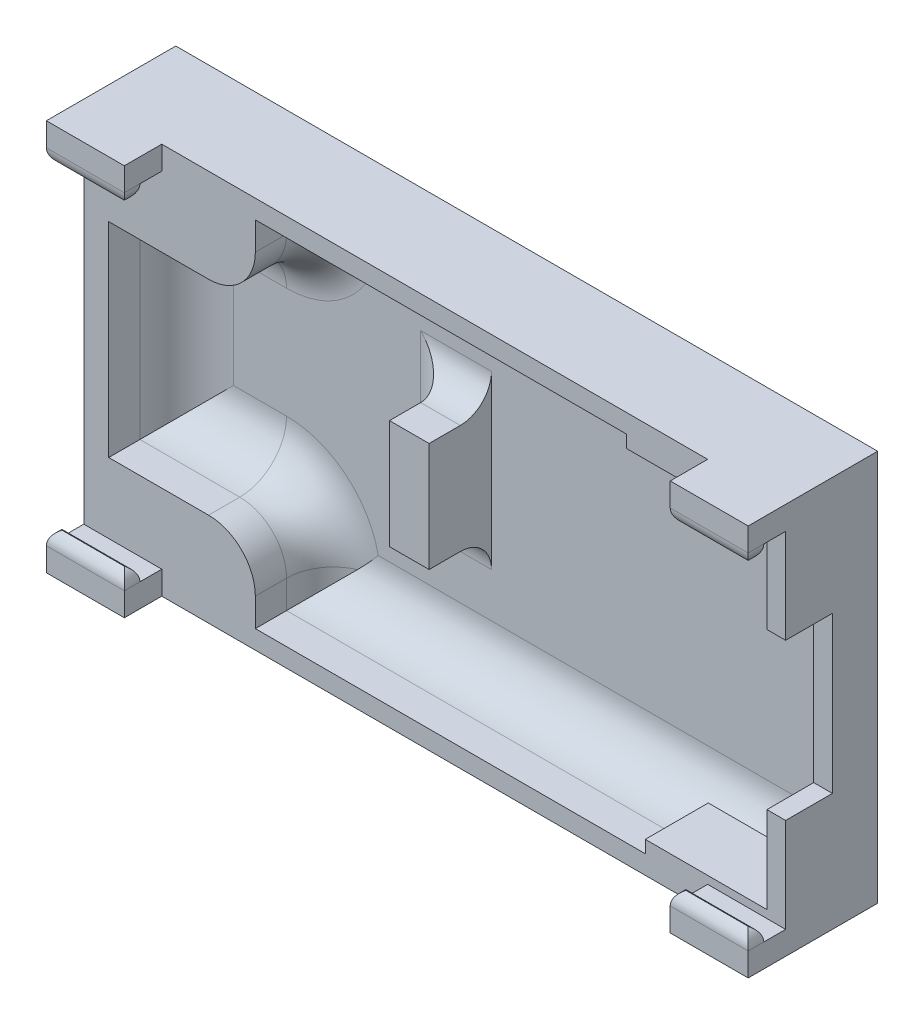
ISO-10303-21;
HEADER;
FILE_DESCRIPTION(('STEP AP214'),'2;1');
FILE_NAME('part.step','',(''),(''),'','','');
FILE_SCHEMA(('AUTOMOTIVE_DESIGN { 1 0 10303 214 1 1 1 1 }'));
ENDSEC;
DATA;
#1=APPLICATION_CONTEXT('core data for automotive mechanical design processes');
#2=APPLICATION_PROTOCOL_DEFINITION('international standard','automotive_design',2000,#1);
#3=PRODUCT_CONTEXT('',#1,'mechanical');
#4=PRODUCT('Part','Part','',(#3));
#5=PRODUCT_RELATED_PRODUCT_CATEGORY('part','',(#4));
#6=PRODUCT_DEFINITION_FORMATION('','',#4);
#7=PRODUCT_DEFINITION_CONTEXT('part definition',#1,'design');
#8=PRODUCT_DEFINITION('design','',#6,#7);
#9=PRODUCT_DEFINITION_SHAPE('','',#8);
#10=(LENGTH_UNIT() NAMED_UNIT(*) SI_UNIT(.MILLI.,.METRE.));
#11=(NAMED_UNIT(*) PLANE_ANGLE_UNIT() SI_UNIT($,.RADIAN.));
#12=(NAMED_UNIT(*) SI_UNIT($,.STERADIAN.) SOLID_ANGLE_UNIT());
#13=UNCERTAINTY_MEASURE_WITH_UNIT(LENGTH_MEASURE(1.E-05),#10,'distance_accuracy_value','');
#14=(GEOMETRIC_REPRESENTATION_CONTEXT(3) GLOBAL_UNCERTAINTY_ASSIGNED_CONTEXT((#13)) GLOBAL_UNIT_ASSIGNED_CONTEXT((#10,
#11,#12)) REPRESENTATION_CONTEXT('',''));
#15=CARTESIAN_POINT('',(0.,0.,0.));
#16=DIRECTION('',(0.,0.,1.));
#17=DIRECTION('',(1.,0.,0.));
#18=AXIS2_PLACEMENT_3D('',#15,#16,#17);
#19=CARTESIAN_POINT('',(0.,0.,-5.));
#20=DIRECTION('',(0.,0.,1.));
#21=DIRECTION('',(1.,0.,0.));
#22=AXIS2_PLACEMENT_3D('',#19,#20,#21);
#23=PLANE('',#22);
#24=CARTESIAN_POINT('',(-10.6,-9.55,-5.));
#25=DIRECTION('',(0.,0.,1.));
#26=DIRECTION('',(1.,0.,0.));
#27=AXIS2_PLACEMENT_3D('',#24,#25,#26);
#28=CIRCLE('',#27,6.);
#29=CARTESIAN_POINT('',(-10.6,-3.55,-5.));
#30=VERTEX_POINT('',#29);
#31=CARTESIAN_POINT('',(-4.72122461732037,-8.35,-5.));
#32=VERTEX_POINT('',#31);
#33=EDGE_CURVE('E705',#30,#32,#28,.F.);
#34=ORIENTED_EDGE('',*,*,#33,.T.);
#35=DIRECTION('',(1.,0.,0.));
#36=VECTOR('',#35,1.);
#37=CARTESIAN_POINT('',(0.,-8.35,-5.));
#38=LINE('',#37,#36);
#39=CARTESIAN_POINT('',(25.2,-8.35,-5.));
#40=VERTEX_POINT('',#39);
#41=EDGE_CURVE('E709',#32,#40,#38,.T.);
#42=ORIENTED_EDGE('',*,*,#41,.T.);
#43=DIRECTION('',(0.,1.,0.));
#44=VECTOR('',#43,1.);
#45=CARTESIAN_POINT('',(25.2,0.,-5.));
#46=LINE('',#45,#44);
#47=CARTESIAN_POINT('',(25.2,8.35,-5.));
#48=VERTEX_POINT('',#47);
#49=EDGE_CURVE('E533',#40,#48,#46,.T.);
#50=ORIENTED_EDGE('',*,*,#49,.T.);
#51=DIRECTION('',(1.,0.,0.));
#52=VECTOR('',#51,1.);
#53=CARTESIAN_POINT('',(-7.6,8.35,-5.));
#54=LINE('',#53,#52);
#55=CARTESIAN_POINT('',(-4.72122461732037,8.35,-5.));
#56=VERTEX_POINT('',#55);
#57=EDGE_CURVE('E707',#48,#56,#54,.F.);
#58=ORIENTED_EDGE('',*,*,#57,.T.);
#59=CARTESIAN_POINT('',(-10.6,9.55,-5.));
#60=DIRECTION('',(0.,0.,1.));
#61=DIRECTION('',(1.,0.,0.));
#62=AXIS2_PLACEMENT_3D('',#59,#60,#61);
#63=CIRCLE('',#62,6.);
#64=CARTESIAN_POINT('',(-10.6,3.55,-5.));
#65=VERTEX_POINT('',#64);
#66=EDGE_CURVE('E703',#56,#65,#63,.F.);
#67=ORIENTED_EDGE('',*,*,#66,.T.);
#68=DIRECTION('',(-1.,0.,0.));
#69=VECTOR('',#68,1.);
#70=CARTESIAN_POINT('',(0.,3.55,-5.));
#71=LINE('',#70,#69);
#72=CARTESIAN_POINT('',(-14.,3.55,-5.));
#73=VERTEX_POINT('',#72);
#74=EDGE_CURVE('E699',#65,#73,#71,.T.);
#75=ORIENTED_EDGE('',*,*,#74,.T.);
#76=DIRECTION('',(0.,1.,0.));
#77=VECTOR('',#76,1.);
#78=CARTESIAN_POINT('',(-14.,-6.55,-5.));
#79=LINE('',#78,#77);
#80=CARTESIAN_POINT('',(-14.,-3.55,-5.));
#81=VERTEX_POINT('',#80);
#82=EDGE_CURVE('E697',#73,#81,#79,.F.);
#83=ORIENTED_EDGE('',*,*,#82,.T.);
#84=DIRECTION('',(-1.,0.,0.));
#85=VECTOR('',#84,1.);
#86=CARTESIAN_POINT('',(-7.6,-3.55,-5.));
#87=LINE('',#86,#85);
#88=EDGE_CURVE('E701',#81,#30,#87,.F.);
#89=ORIENTED_EDGE('',*,*,#88,.T.);
#90=EDGE_LOOP('',(#34,#42,#50,#58,#67,#75,#83,#89));
#91=FACE_BOUND('',#90,.T.);
#92=DIRECTION('',(-1.,0.,0.));
#93=VECTOR('',#92,1.);
#94=CARTESIAN_POINT('',(0.,5.5,-5.));
#95=LINE('',#94,#93);
#96=CARTESIAN_POINT('',(-2.,5.5,-5.));
#97=VERTEX_POINT('',#96);
#98=CARTESIAN_POINT('',(2.54,5.5,-5.));
#99=VERTEX_POINT('',#98);
#100=EDGE_CURVE('E815',#97,#99,#95,.F.);
#101=ORIENTED_EDGE('',*,*,#100,.T.);
#102=DIRECTION('',(0.,1.,0.));
#103=VECTOR('',#102,1.);
#104=CARTESIAN_POINT('',(2.54,-3.5,-5.));
#105=LINE('',#104,#103);
#106=CARTESIAN_POINT('',(2.54,-5.5,-5.));
#107=VERTEX_POINT('',#106);
#108=EDGE_CURVE('E389',#107,#99,#105,.T.);
#109=ORIENTED_EDGE('',*,*,#108,.F.);
#110=DIRECTION('',(1.,0.,0.));
#111=VECTOR('',#110,1.);
#112=CARTESIAN_POINT('',(0.,-5.5,-5.));
#113=LINE('',#112,#111);
#114=CARTESIAN_POINT('',(-2.,-5.5,-5.));
#115=VERTEX_POINT('',#114);
#116=EDGE_CURVE('E813',#107,#115,#113,.F.);
#117=ORIENTED_EDGE('',*,*,#116,.T.);
#118=DIRECTION('',(0.,-1.,0.));
#119=VECTOR('',#118,1.);
#120=CARTESIAN_POINT('',(-2.,0.,-5.));
#121=LINE('',#120,#119);
#122=EDGE_CURVE('E811',#115,#97,#121,.F.);
#123=ORIENTED_EDGE('',*,*,#122,.T.);
#124=EDGE_LOOP('',(#101,#109,#117,#123));
#125=FACE_BOUND('',#124,.T.);
#126=ADVANCED_FACE('F37',(#91,#125),#23,.T.);
#127=CARTESIAN_POINT('',(25.4,11.05,0.));
#128=DIRECTION('',(0.,0.,1.));
#129=DIRECTION('',(1.,0.,0.));
#130=AXIS2_PLACEMENT_3D('',#127,#128,#129);
#131=CYLINDRICAL_SURFACE('',#130,1.);
#132=CARTESIAN_POINT('',(25.4,11.05,1.4));
#133=DIRECTION('',(-0.707106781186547,0.,0.707106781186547));
#134=DIRECTION('',(0.707106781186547,0.,0.707106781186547));
#135=AXIS2_PLACEMENT_3D('',#132,#133,#134);
#136=ELLIPSE('',#135,1.41421356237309,1.);
#137=CARTESIAN_POINT('',(26.4,11.05,2.4));
#138=VERTEX_POINT('',#137);
#139=CARTESIAN_POINT('',(25.9,10.1839745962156,1.9));
#140=VERTEX_POINT('',#139);
#141=EDGE_CURVE('E681',#138,#140,#136,.F.);
#142=ORIENTED_EDGE('',*,*,#141,.T.);
#143=CARTESIAN_POINT('',(25.4,11.05,2.4));
#144=DIRECTION('',(0.707106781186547,0.,0.707106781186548));
#145=DIRECTION('',(-0.707106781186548,0.,0.707106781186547));
#146=AXIS2_PLACEMENT_3D('',#143,#144,#145);
#147=ELLIPSE('',#146,1.41421356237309,1.);
#148=CARTESIAN_POINT('',(26.4,11.05,1.4));
#149=VERTEX_POINT('',#148);
#150=EDGE_CURVE('E675',#149,#140,#147,.F.);
#151=ORIENTED_EDGE('',*,*,#150,.F.);
#152=DIRECTION('',(0.,0.,1.));
#153=VECTOR('',#152,1.);
#154=CARTESIAN_POINT('',(26.4,11.05,-5.));
#155=LINE('',#154,#153);
#156=EDGE_CURVE('E628',#138,#149,#155,.F.);
#157=ORIENTED_EDGE('',*,*,#156,.F.);
#158=EDGE_LOOP('',(#142,#151,#157));
#159=FACE_BOUND('',#158,.T.);
#160=ADVANCED_FACE('F851',(#159),#131,.T.);
#161=CARTESIAN_POINT('',(0.,11.05,1.4));
#162=DIRECTION('',(-1.,0.,0.));
#163=DIRECTION('',(0.,0.,1.));
#164=AXIS2_PLACEMENT_3D('',#161,#162,#163);
#165=CYLINDRICAL_SURFACE('',#164,1.);
#166=DIRECTION('',(-1.,0.,0.));
#167=VECTOR('',#166,1.);
#168=CARTESIAN_POINT('',(0.,10.1839745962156,1.9));
#169=LINE('',#168,#167);
#170=CARTESIAN_POINT('',(21.9,10.1839745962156,1.9));
#171=VERTEX_POINT('',#170);
#172=EDGE_CURVE('E644',#140,#171,#169,.T.);
#173=ORIENTED_EDGE('',*,*,#172,.F.);
#174=ORIENTED_EDGE('',*,*,#141,.F.);
#175=DIRECTION('',(-1.,0.,0.));
#176=VECTOR('',#175,1.);
#177=CARTESIAN_POINT('',(0.,11.05,2.4));
#178=LINE('',#177,#176);
#179=CARTESIAN_POINT('',(21.4,11.05,2.4));
#180=VERTEX_POINT('',#179);
#181=EDGE_CURVE('E642',#180,#138,#178,.F.);
#182=ORIENTED_EDGE('',*,*,#181,.F.);
#183=CARTESIAN_POINT('',(22.4,11.05,1.4));
#184=DIRECTION('',(-0.707106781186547,0.,-0.707106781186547));
#185=DIRECTION('',(-0.707106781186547,0.,0.707106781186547));
#186=AXIS2_PLACEMENT_3D('',#183,#184,#185);
#187=ELLIPSE('',#186,1.41421356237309,1.);
#188=EDGE_CURVE('E669',#171,#180,#187,.T.);
#189=ORIENTED_EDGE('',*,*,#188,.F.);
#190=EDGE_LOOP('',(#173,#174,#182,#189));
#191=FACE_BOUND('',#190,.T.);
#192=ADVANCED_FACE('F857',(#191),#165,.T.);
#193=CARTESIAN_POINT('',(22.4,11.05,0.));
#194=DIRECTION('',(0.,0.,-1.));
#195=DIRECTION('',(-1.,0.,0.));
#196=AXIS2_PLACEMENT_3D('',#193,#194,#195);
#197=CYLINDRICAL_SURFACE('',#196,1.);
#198=CARTESIAN_POINT('',(22.4,11.05,2.4));
#199=DIRECTION('',(0.707106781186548,0.,-0.707106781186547));
#200=DIRECTION('',(-0.707106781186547,0.,-0.707106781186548));
#201=AXIS2_PLACEMENT_3D('',#198,#199,#200);
#202=ELLIPSE('',#201,1.4142135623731,1.);
#203=CARTESIAN_POINT('',(21.4,11.05,1.4));
#204=VERTEX_POINT('',#203);
#205=EDGE_CURVE('E678',#171,#204,#202,.T.);
#206=ORIENTED_EDGE('',*,*,#205,.F.);
#207=ORIENTED_EDGE('',*,*,#188,.T.);
#208=DIRECTION('',(0.,0.,-1.));
#209=VECTOR('',#208,1.);
#210=CARTESIAN_POINT('',(21.4,11.05,2.4));
#211=LINE('',#210,#209);
#212=EDGE_CURVE('E639',#204,#180,#211,.F.);
#213=ORIENTED_EDGE('',*,*,#212,.F.);
#214=EDGE_LOOP('',(#206,#207,#213));
#215=FACE_BOUND('',#214,.T.);
#216=ADVANCED_FACE('F997',(#215),#197,.T.);
#217=CARTESIAN_POINT('',(0.,11.05,2.4));
#218=DIRECTION('',(1.,0.,0.));
#219=DIRECTION('',(0.,0.,-1.));
#220=AXIS2_PLACEMENT_3D('',#217,#218,#219);
#221=CYLINDRICAL_SURFACE('',#220,1.);
#222=ORIENTED_EDGE('',*,*,#150,.T.);
#223=ORIENTED_EDGE('',*,*,#172,.T.);
#224=ORIENTED_EDGE('',*,*,#205,.T.);
#225=DIRECTION('',(1.,0.,0.));
#226=VECTOR('',#225,1.);
#227=CARTESIAN_POINT('',(26.4,11.05,1.4));
#228=LINE('',#227,#226);
#229=EDGE_CURVE('E410',#204,#149,#228,.T.);
#230=ORIENTED_EDGE('',*,*,#229,.T.);
#231=EDGE_LOOP('',(#222,#223,#224,#230));
#232=FACE_BOUND('',#231,.T.);
#233=ADVANCED_FACE('F988',(#232),#221,.T.);
#234=CARTESIAN_POINT('',(22.4,-11.05,0.));
#235=DIRECTION('',(0.,0.,1.));
#236=DIRECTION('',(1.,0.,0.));
#237=AXIS2_PLACEMENT_3D('',#234,#235,#236);
#238=CYLINDRICAL_SURFACE('',#237,1.);
#239=CARTESIAN_POINT('',(22.4,-11.05,1.4));
#240=DIRECTION('',(0.707106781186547,0.,0.707106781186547));
#241=DIRECTION('',(-0.707106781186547,0.,0.707106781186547));
#242=AXIS2_PLACEMENT_3D('',#239,#240,#241);
#243=ELLIPSE('',#242,1.41421356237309,1.);
#244=CARTESIAN_POINT('',(21.4,-11.05,2.4));
#245=VERTEX_POINT('',#244);
#246=CARTESIAN_POINT('',(21.9,-10.1839745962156,1.9));
#247=VERTEX_POINT('',#246);
#248=EDGE_CURVE('E671',#245,#247,#243,.F.);
#249=ORIENTED_EDGE('',*,*,#248,.T.);
#250=CARTESIAN_POINT('',(22.4,-11.05,2.4));
#251=DIRECTION('',(-0.707106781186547,0.,0.707106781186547));
#252=DIRECTION('',(0.707106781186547,0.,0.707106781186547));
#253=AXIS2_PLACEMENT_3D('',#250,#251,#252);
#254=ELLIPSE('',#253,1.41421356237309,1.);
#255=CARTESIAN_POINT('',(21.4,-11.05,1.4));
#256=VERTEX_POINT('',#255);
#257=EDGE_CURVE('E665',#256,#247,#254,.F.);
#258=ORIENTED_EDGE('',*,*,#257,.F.);
#259=DIRECTION('',(0.,0.,1.));
#260=VECTOR('',#259,1.);
#261=CARTESIAN_POINT('',(21.4,-11.05,2.4));
#262=LINE('',#261,#260);
#263=EDGE_CURVE('E636',#245,#256,#262,.F.);
#264=ORIENTED_EDGE('',*,*,#263,.F.);
#265=EDGE_LOOP('',(#249,#258,#264));
#266=FACE_BOUND('',#265,.T.);
#267=ADVANCED_FACE('F984',(#266),#238,.T.);
#268=CARTESIAN_POINT('',(0.,-11.05,1.4));
#269=DIRECTION('',(-1.,0.,0.));
#270=DIRECTION('',(0.,0.,1.));
#271=AXIS2_PLACEMENT_3D('',#268,#269,#270);
#272=CYLINDRICAL_SURFACE('',#271,1.);
#273=DIRECTION('',(1.,0.,0.));
#274=VECTOR('',#273,1.);
#275=CARTESIAN_POINT('',(0.,-10.1839745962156,1.9));
#276=LINE('',#275,#274);
#277=CARTESIAN_POINT('',(25.9,-10.1839745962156,1.9));
#278=VERTEX_POINT('',#277);
#279=EDGE_CURVE('E686',#247,#278,#276,.T.);
#280=ORIENTED_EDGE('',*,*,#279,.F.);
#281=ORIENTED_EDGE('',*,*,#248,.F.);
#282=DIRECTION('',(1.,0.,0.));
#283=VECTOR('',#282,1.);
#284=CARTESIAN_POINT('',(21.4,-11.05,2.4));
#285=LINE('',#284,#283);
#286=CARTESIAN_POINT('',(26.4,-11.05,2.4));
#287=VERTEX_POINT('',#286);
#288=EDGE_CURVE('E634',#287,#245,#285,.F.);
#289=ORIENTED_EDGE('',*,*,#288,.F.);
#290=CARTESIAN_POINT('',(25.4,-11.05,1.4));
#291=DIRECTION('',(-0.707106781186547,0.,0.707106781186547));
#292=DIRECTION('',(-0.707106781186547,0.,-0.707106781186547));
#293=AXIS2_PLACEMENT_3D('',#290,#291,#292);
#294=ELLIPSE('',#293,1.41421356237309,1.);
#295=EDGE_CURVE('E659',#278,#287,#294,.F.);
#296=ORIENTED_EDGE('',*,*,#295,.F.);
#297=EDGE_LOOP('',(#280,#281,#289,#296));
#298=FACE_BOUND('',#297,.T.);
#299=ADVANCED_FACE('F987',(#298),#272,.T.);
#300=CARTESIAN_POINT('',(25.4,-11.05,0.));
#301=DIRECTION('',(0.,0.,-1.));
#302=DIRECTION('',(-1.,0.,0.));
#303=AXIS2_PLACEMENT_3D('',#300,#301,#302);
#304=CYLINDRICAL_SURFACE('',#303,1.);
#305=CARTESIAN_POINT('',(25.4,-11.05,2.4));
#306=DIRECTION('',(-0.707106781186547,0.,-0.707106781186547));
#307=DIRECTION('',(0.707106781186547,0.,-0.707106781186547));
#308=AXIS2_PLACEMENT_3D('',#305,#306,#307);
#309=ELLIPSE('',#308,1.41421356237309,1.);
#310=CARTESIAN_POINT('',(26.4,-11.05,1.4));
#311=VERTEX_POINT('',#310);
#312=EDGE_CURVE('E668',#278,#311,#309,.T.);
#313=ORIENTED_EDGE('',*,*,#312,.F.);
#314=ORIENTED_EDGE('',*,*,#295,.T.);
#315=DIRECTION('',(0.,0.,-1.));
#316=VECTOR('',#315,1.);
#317=CARTESIAN_POINT('',(26.4,-11.05,-5.));
#318=LINE('',#317,#316);
#319=EDGE_CURVE('E631',#311,#287,#318,.F.);
#320=ORIENTED_EDGE('',*,*,#319,.F.);
#321=EDGE_LOOP('',(#313,#314,#320));
#322=FACE_BOUND('',#321,.T.);
#323=ADVANCED_FACE('F982',(#322),#304,.T.);
#324=CARTESIAN_POINT('',(0.,-11.05,2.4));
#325=DIRECTION('',(-1.,0.,0.));
#326=DIRECTION('',(0.,0.,1.));
#327=AXIS2_PLACEMENT_3D('',#324,#325,#326);
#328=CYLINDRICAL_SURFACE('',#327,1.);
#329=ORIENTED_EDGE('',*,*,#257,.T.);
#330=ORIENTED_EDGE('',*,*,#279,.T.);
#331=ORIENTED_EDGE('',*,*,#312,.T.);
#332=DIRECTION('',(-1.,0.,0.));
#333=VECTOR('',#332,1.);
#334=CARTESIAN_POINT('',(21.4,-11.05,1.4));
#335=LINE('',#334,#333);
#336=EDGE_CURVE('E403',#311,#256,#335,.T.);
#337=ORIENTED_EDGE('',*,*,#336,.T.);
#338=EDGE_LOOP('',(#329,#330,#331,#337));
#339=FACE_BOUND('',#338,.T.);
#340=ADVANCED_FACE('F972',(#339),#328,.T.);
#341=CARTESIAN_POINT('',(-17.6,-11.05,0.));
#342=DIRECTION('',(0.,0.,-1.));
#343=DIRECTION('',(-1.,0.,0.));
#344=AXIS2_PLACEMENT_3D('',#341,#342,#343);
#345=CYLINDRICAL_SURFACE('',#344,1.);
#346=CARTESIAN_POINT('',(-17.6,-11.05,1.4));
#347=DIRECTION('',(-0.707106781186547,0.,-0.707106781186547));
#348=DIRECTION('',(0.707106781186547,0.,-0.707106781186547));
#349=AXIS2_PLACEMENT_3D('',#346,#347,#348);
#350=ELLIPSE('',#349,1.41421356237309,1.);
#351=CARTESIAN_POINT('',(-18.6,-11.05,2.4));
#352=VERTEX_POINT('',#351);
#353=CARTESIAN_POINT('',(-18.1,-10.1839745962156,1.9));
#354=VERTEX_POINT('',#353);
#355=EDGE_CURVE('E661',#352,#354,#350,.T.);
#356=ORIENTED_EDGE('',*,*,#355,.T.);
#357=CARTESIAN_POINT('',(-17.6,-11.05,2.4));
#358=DIRECTION('',(0.707106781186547,0.,-0.707106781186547));
#359=DIRECTION('',(-0.707106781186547,0.,-0.707106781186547));
#360=AXIS2_PLACEMENT_3D('',#357,#358,#359);
#361=ELLIPSE('',#360,1.41421356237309,1.);
#362=CARTESIAN_POINT('',(-18.6,-11.05,1.4));
#363=VERTEX_POINT('',#362);
#364=EDGE_CURVE('E655',#363,#354,#361,.T.);
#365=ORIENTED_EDGE('',*,*,#364,.F.);
#366=DIRECTION('',(0.,0.,1.));
#367=VECTOR('',#366,1.);
#368=CARTESIAN_POINT('',(-18.6,-11.05,0.));
#369=LINE('',#368,#367);
#370=EDGE_CURVE('E585',#352,#363,#369,.F.);
#371=ORIENTED_EDGE('',*,*,#370,.F.);
#372=EDGE_LOOP('',(#356,#365,#371));
#373=FACE_BOUND('',#372,.T.);
#374=ADVANCED_FACE('F968',(#373),#345,.T.);
#375=CARTESIAN_POINT('',(0.,-11.05,1.4));
#376=DIRECTION('',(1.,0.,0.));
#377=DIRECTION('',(0.,0.,-1.));
#378=AXIS2_PLACEMENT_3D('',#375,#376,#377);
#379=CYLINDRICAL_SURFACE('',#378,1.);
#380=DIRECTION('',(1.,0.,0.));
#381=VECTOR('',#380,1.);
#382=CARTESIAN_POINT('',(0.,-10.1839745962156,1.9));
#383=LINE('',#382,#381);
#384=CARTESIAN_POINT('',(-14.1,-10.1839745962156,1.9));
#385=VERTEX_POINT('',#384);
#386=EDGE_CURVE('E688',#354,#385,#383,.T.);
#387=ORIENTED_EDGE('',*,*,#386,.F.);
#388=ORIENTED_EDGE('',*,*,#355,.F.);
#389=DIRECTION('',(1.,0.,0.));
#390=VECTOR('',#389,1.);
#391=CARTESIAN_POINT('',(0.,-11.05,2.4));
#392=LINE('',#391,#390);
#393=CARTESIAN_POINT('',(-13.6,-11.05,2.4));
#394=VERTEX_POINT('',#393);
#395=EDGE_CURVE('E626',#394,#352,#392,.F.);
#396=ORIENTED_EDGE('',*,*,#395,.F.);
#397=CARTESIAN_POINT('',(-14.6,-11.05,1.4));
#398=DIRECTION('',(0.707106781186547,0.,-0.707106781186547));
#399=DIRECTION('',(0.707106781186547,0.,0.707106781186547));
#400=AXIS2_PLACEMENT_3D('',#397,#398,#399);
#401=ELLIPSE('',#400,1.41421356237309,1.);
#402=EDGE_CURVE('E649',#385,#394,#401,.T.);
#403=ORIENTED_EDGE('',*,*,#402,.F.);
#404=EDGE_LOOP('',(#387,#388,#396,#403));
#405=FACE_BOUND('',#404,.T.);
#406=ADVANCED_FACE('F971',(#405),#379,.T.);
#407=CARTESIAN_POINT('',(-14.6,-11.05,0.));
#408=DIRECTION('',(0.,0.,-1.));
#409=DIRECTION('',(-1.,0.,0.));
#410=AXIS2_PLACEMENT_3D('',#407,#408,#409);
#411=CYLINDRICAL_SURFACE('',#410,1.);
#412=CARTESIAN_POINT('',(-14.6,-11.05,2.4));
#413=DIRECTION('',(-0.707106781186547,0.,-0.707106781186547));
#414=DIRECTION('',(0.707106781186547,0.,-0.707106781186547));
#415=AXIS2_PLACEMENT_3D('',#412,#413,#414);
#416=ELLIPSE('',#415,1.41421356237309,1.);
#417=CARTESIAN_POINT('',(-13.6,-11.05,1.4));
#418=VERTEX_POINT('',#417);
#419=EDGE_CURVE('E658',#385,#418,#416,.T.);
#420=ORIENTED_EDGE('',*,*,#419,.F.);
#421=ORIENTED_EDGE('',*,*,#402,.T.);
#422=DIRECTION('',(0.,0.,-1.));
#423=VECTOR('',#422,1.);
#424=CARTESIAN_POINT('',(-13.6,-11.05,2.4));
#425=LINE('',#424,#423);
#426=EDGE_CURVE('E623',#418,#394,#425,.F.);
#427=ORIENTED_EDGE('',*,*,#426,.F.);
#428=EDGE_LOOP('',(#420,#421,#427));
#429=FACE_BOUND('',#428,.T.);
#430=ADVANCED_FACE('F966',(#429),#411,.T.);
#431=CARTESIAN_POINT('',(0.,-11.05,2.4));
#432=DIRECTION('',(-1.,0.,0.));
#433=DIRECTION('',(0.,0.,1.));
#434=AXIS2_PLACEMENT_3D('',#431,#432,#433);
#435=CYLINDRICAL_SURFACE('',#434,1.);
#436=ORIENTED_EDGE('',*,*,#364,.T.);
#437=ORIENTED_EDGE('',*,*,#386,.T.);
#438=ORIENTED_EDGE('',*,*,#419,.T.);
#439=DIRECTION('',(-1.,0.,0.));
#440=VECTOR('',#439,1.);
#441=CARTESIAN_POINT('',(-18.6,-11.05,1.4));
#442=LINE('',#441,#440);
#443=EDGE_CURVE('E400',#418,#363,#442,.T.);
#444=ORIENTED_EDGE('',*,*,#443,.T.);
#445=EDGE_LOOP('',(#436,#437,#438,#444));
#446=FACE_BOUND('',#445,.T.);
#447=ADVANCED_FACE('F956',(#446),#435,.T.);
#448=CARTESIAN_POINT('',(-14.6,11.05,0.));
#449=DIRECTION('',(0.,0.,1.));
#450=DIRECTION('',(1.,0.,0.));
#451=AXIS2_PLACEMENT_3D('',#448,#449,#450);
#452=CYLINDRICAL_SURFACE('',#451,1.);
#453=CARTESIAN_POINT('',(-14.6,11.05,1.4));
#454=DIRECTION('',(-0.707106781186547,0.,0.707106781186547));
#455=DIRECTION('',(0.707106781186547,0.,0.707106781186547));
#456=AXIS2_PLACEMENT_3D('',#453,#454,#455);
#457=ELLIPSE('',#456,1.41421356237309,1.);
#458=CARTESIAN_POINT('',(-13.6,11.05,2.4));
#459=VERTEX_POINT('',#458);
#460=CARTESIAN_POINT('',(-14.1,10.1839745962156,1.9));
#461=VERTEX_POINT('',#460);
#462=EDGE_CURVE('E651',#459,#461,#457,.F.);
#463=ORIENTED_EDGE('',*,*,#462,.T.);
#464=CARTESIAN_POINT('',(-14.6,11.05,2.4));
#465=DIRECTION('',(0.707106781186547,0.,0.707106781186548));
#466=DIRECTION('',(-0.707106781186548,0.,0.707106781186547));
#467=AXIS2_PLACEMENT_3D('',#464,#465,#466);
#468=ELLIPSE('',#467,1.41421356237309,1.);
#469=CARTESIAN_POINT('',(-13.6,11.05,1.4));
#470=VERTEX_POINT('',#469);
#471=EDGE_CURVE('E645',#470,#461,#468,.F.);
#472=ORIENTED_EDGE('',*,*,#471,.F.);
#473=DIRECTION('',(0.,0.,1.));
#474=VECTOR('',#473,1.);
#475=CARTESIAN_POINT('',(-13.6,11.05,2.4));
#476=LINE('',#475,#474);
#477=EDGE_CURVE('E620',#459,#470,#476,.F.);
#478=ORIENTED_EDGE('',*,*,#477,.F.);
#479=EDGE_LOOP('',(#463,#472,#478));
#480=FACE_BOUND('',#479,.T.);
#481=ADVANCED_FACE('F952',(#480),#452,.T.);
#482=CARTESIAN_POINT('',(0.,11.05,1.4));
#483=DIRECTION('',(1.,0.,0.));
#484=DIRECTION('',(0.,0.,-1.));
#485=AXIS2_PLACEMENT_3D('',#482,#483,#484);
#486=CYLINDRICAL_SURFACE('',#485,1.);
#487=DIRECTION('',(-1.,0.,0.));
#488=VECTOR('',#487,1.);
#489=CARTESIAN_POINT('',(0.,10.1839745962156,1.9));
#490=LINE('',#489,#488);
#491=CARTESIAN_POINT('',(-18.1,10.1839745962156,1.9));
#492=VERTEX_POINT('',#491);
#493=EDGE_CURVE('E690',#461,#492,#490,.T.);
#494=ORIENTED_EDGE('',*,*,#493,.F.);
#495=ORIENTED_EDGE('',*,*,#462,.F.);
#496=DIRECTION('',(-1.,0.,0.));
#497=VECTOR('',#496,1.);
#498=CARTESIAN_POINT('',(-13.6,11.05,2.4));
#499=LINE('',#498,#497);
#500=CARTESIAN_POINT('',(-18.6,11.05,2.4));
#501=VERTEX_POINT('',#500);
#502=EDGE_CURVE('E618',#501,#459,#499,.F.);
#503=ORIENTED_EDGE('',*,*,#502,.F.);
#504=CARTESIAN_POINT('',(-17.6,11.05,1.4));
#505=DIRECTION('',(0.707106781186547,0.,0.707106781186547));
#506=DIRECTION('',(0.707106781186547,0.,-0.707106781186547));
#507=AXIS2_PLACEMENT_3D('',#504,#505,#506);
#508=ELLIPSE('',#507,1.41421356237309,1.);
#509=EDGE_CURVE('E404',#492,#501,#508,.F.);
#510=ORIENTED_EDGE('',*,*,#509,.F.);
#511=EDGE_LOOP('',(#494,#495,#503,#510));
#512=FACE_BOUND('',#511,.T.);
#513=ADVANCED_FACE('F955',(#512),#486,.T.);
#514=CARTESIAN_POINT('',(-17.6,11.05,0.));
#515=DIRECTION('',(0.,0.,1.));
#516=DIRECTION('',(1.,0.,0.));
#517=AXIS2_PLACEMENT_3D('',#514,#515,#516);
#518=CYLINDRICAL_SURFACE('',#517,1.);
#519=CARTESIAN_POINT('',(-17.6,11.05,2.4));
#520=DIRECTION('',(-0.707106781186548,0.,0.707106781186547));
#521=DIRECTION('',(0.707106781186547,0.,0.707106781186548));
#522=AXIS2_PLACEMENT_3D('',#519,#520,#521);
#523=ELLIPSE('',#522,1.4142135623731,1.);
#524=CARTESIAN_POINT('',(-18.6,11.05,1.4));
#525=VERTEX_POINT('',#524);
#526=EDGE_CURVE('E648',#492,#525,#523,.F.);
#527=ORIENTED_EDGE('',*,*,#526,.F.);
#528=ORIENTED_EDGE('',*,*,#509,.T.);
#529=DIRECTION('',(0.,0.,-1.));
#530=VECTOR('',#529,1.);
#531=CARTESIAN_POINT('',(-18.6,11.05,0.));
#532=LINE('',#531,#530);
#533=EDGE_CURVE('E615',#525,#501,#532,.F.);
#534=ORIENTED_EDGE('',*,*,#533,.F.);
#535=EDGE_LOOP('',(#527,#528,#534));
#536=FACE_BOUND('',#535,.T.);
#537=ADVANCED_FACE('F950',(#536),#518,.T.);
#538=CARTESIAN_POINT('',(0.,11.05,2.4));
#539=DIRECTION('',(1.,0.,0.));
#540=DIRECTION('',(0.,0.,-1.));
#541=AXIS2_PLACEMENT_3D('',#538,#539,#540);
#542=CYLINDRICAL_SURFACE('',#541,1.);
#543=ORIENTED_EDGE('',*,*,#471,.T.);
#544=ORIENTED_EDGE('',*,*,#493,.T.);
#545=ORIENTED_EDGE('',*,*,#526,.T.);
#546=DIRECTION('',(1.,0.,0.));
#547=VECTOR('',#546,1.);
#548=CARTESIAN_POINT('',(-13.6,11.05,1.4));
#549=LINE('',#548,#547);
#550=EDGE_CURVE('E407',#525,#470,#549,.T.);
#551=ORIENTED_EDGE('',*,*,#550,.T.);
#552=EDGE_LOOP('',(#543,#544,#545,#551));
#553=FACE_BOUND('',#552,.T.);
#554=ADVANCED_FACE('F946',(#553),#542,.T.);
#555=CARTESIAN_POINT('',(-18.6,-11.05,2.4));
#556=DIRECTION('',(0.,-1.,0.));
#557=DIRECTION('',(0.,0.,-1.));
#558=AXIS2_PLACEMENT_3D('',#555,#556,#557);
#559=PLANE('',#558);
#560=ORIENTED_EDGE('',*,*,#443,.F.);
#561=DIRECTION('',(0.,0.,-1.));
#562=VECTOR('',#561,1.);
#563=CARTESIAN_POINT('',(-13.6,-11.05,2.4));
#564=LINE('',#563,#562);
#565=CARTESIAN_POINT('',(-13.6,-11.05,0.));
#566=VERTEX_POINT('',#565);
#567=EDGE_CURVE('E449',#418,#566,#564,.T.);
#568=ORIENTED_EDGE('',*,*,#567,.T.);
#569=DIRECTION('',(-1.,0.,0.));
#570=VECTOR('',#569,1.);
#571=CARTESIAN_POINT('',(-18.6,-11.05,0.));
#572=LINE('',#571,#570);
#573=CARTESIAN_POINT('',(-18.6,-11.05,0.));
#574=VERTEX_POINT('',#573);
#575=EDGE_CURVE('E438',#566,#574,#572,.T.);
#576=ORIENTED_EDGE('',*,*,#575,.T.);
#577=DIRECTION('',(0.,0.,-1.));
#578=VECTOR('',#577,1.);
#579=CARTESIAN_POINT('',(-18.6,-11.05,2.4));
#580=LINE('',#579,#578);
#581=EDGE_CURVE('E443',#363,#574,#580,.T.);
#582=ORIENTED_EDGE('',*,*,#581,.F.);
#583=EDGE_LOOP('',(#560,#568,#576,#582));
#584=FACE_BOUND('',#583,.T.);
#585=ADVANCED_FACE('F949',(#584),#559,.F.);
#586=CARTESIAN_POINT('',(26.4,-11.05,2.4));
#587=DIRECTION('',(0.,-1.,0.));
#588=DIRECTION('',(1.,0.,0.));
#589=AXIS2_PLACEMENT_3D('',#586,#587,#588);
#590=PLANE('',#589);
#591=ORIENTED_EDGE('',*,*,#336,.F.);
#592=DIRECTION('',(0.,0.,-1.));
#593=VECTOR('',#592,1.);
#594=CARTESIAN_POINT('',(26.4,-11.05,2.4));
#595=LINE('',#594,#593);
#596=CARTESIAN_POINT('',(26.4,-11.05,0.));
#597=VERTEX_POINT('',#596);
#598=EDGE_CURVE('E432',#311,#597,#595,.T.);
#599=ORIENTED_EDGE('',*,*,#598,.T.);
#600=DIRECTION('',(-1.,0.,0.));
#601=VECTOR('',#600,1.);
#602=CARTESIAN_POINT('',(26.4,-11.05,0.));
#603=LINE('',#602,#601);
#604=CARTESIAN_POINT('',(21.4,-11.05,0.));
#605=VERTEX_POINT('',#604);
#606=EDGE_CURVE('E413',#597,#605,#603,.T.);
#607=ORIENTED_EDGE('',*,*,#606,.T.);
#608=DIRECTION('',(0.,0.,-1.));
#609=VECTOR('',#608,1.);
#610=CARTESIAN_POINT('',(21.4,-11.05,2.4));
#611=LINE('',#610,#609);
#612=EDGE_CURVE('E430',#256,#605,#611,.T.);
#613=ORIENTED_EDGE('',*,*,#612,.F.);
#614=EDGE_LOOP('',(#591,#599,#607,#613));
#615=FACE_BOUND('',#614,.T.);
#616=ADVANCED_FACE('F1156',(#615),#590,.F.);
#617=CARTESIAN_POINT('',(-18.6,11.05,2.4));
#618=DIRECTION('',(0.,1.,0.));
#619=DIRECTION('',(0.,0.,1.));
#620=AXIS2_PLACEMENT_3D('',#617,#618,#619);
#621=PLANE('',#620);
#622=ORIENTED_EDGE('',*,*,#550,.F.);
#623=DIRECTION('',(0.,0.,-1.));
#624=VECTOR('',#623,1.);
#625=CARTESIAN_POINT('',(-18.6,11.05,2.4));
#626=LINE('',#625,#624);
#627=CARTESIAN_POINT('',(-18.6,11.05,0.));
#628=VERTEX_POINT('',#627);
#629=EDGE_CURVE('E472',#525,#628,#626,.T.);
#630=ORIENTED_EDGE('',*,*,#629,.T.);
#631=DIRECTION('',(1.,0.,0.));
#632=VECTOR('',#631,1.);
#633=CARTESIAN_POINT('',(-18.6,11.05,0.));
#634=LINE('',#633,#632);
#635=CARTESIAN_POINT('',(-13.6,11.05,0.));
#636=VERTEX_POINT('',#635);
#637=EDGE_CURVE('E454',#628,#636,#634,.T.);
#638=ORIENTED_EDGE('',*,*,#637,.T.);
#639=DIRECTION('',(0.,0.,-1.));
#640=VECTOR('',#639,1.);
#641=CARTESIAN_POINT('',(-13.6,11.05,2.4));
#642=LINE('',#641,#640);
#643=EDGE_CURVE('E470',#470,#636,#642,.T.);
#644=ORIENTED_EDGE('',*,*,#643,.F.);
#645=EDGE_LOOP('',(#622,#630,#638,#644));
#646=FACE_BOUND('',#645,.T.);
#647=ADVANCED_FACE('F1113',(#646),#621,.F.);
#648=CARTESIAN_POINT('',(26.4,11.05,2.4));
#649=DIRECTION('',(0.,1.,0.));
#650=DIRECTION('',(-1.,0.,0.));
#651=AXIS2_PLACEMENT_3D('',#648,#649,#650);
#652=PLANE('',#651);
#653=ORIENTED_EDGE('',*,*,#229,.F.);
#654=DIRECTION('',(0.,0.,-1.));
#655=VECTOR('',#654,1.);
#656=CARTESIAN_POINT('',(21.4,11.05,2.4));
#657=LINE('',#656,#655);
#658=CARTESIAN_POINT('',(21.4,11.05,0.));
#659=VERTEX_POINT('',#658);
#660=EDGE_CURVE('E489',#204,#659,#657,.T.);
#661=ORIENTED_EDGE('',*,*,#660,.T.);
#662=DIRECTION('',(1.,0.,0.));
#663=VECTOR('',#662,1.);
#664=CARTESIAN_POINT('',(26.4,11.05,0.));
#665=LINE('',#664,#663);
#666=CARTESIAN_POINT('',(26.4,11.05,0.));
#667=VERTEX_POINT('',#666);
#668=EDGE_CURVE('E478',#659,#667,#665,.T.);
#669=ORIENTED_EDGE('',*,*,#668,.T.);
#670=DIRECTION('',(0.,0.,-1.));
#671=VECTOR('',#670,1.);
#672=CARTESIAN_POINT('',(26.4,11.05,2.4));
#673=LINE('',#672,#671);
#674=EDGE_CURVE('E483',#149,#667,#673,.T.);
#675=ORIENTED_EDGE('',*,*,#674,.F.);
#676=EDGE_LOOP('',(#653,#661,#669,#675));
#677=FACE_BOUND('',#676,.T.);
#678=ADVANCED_FACE('F882',(#677),#652,.F.);
#679=CARTESIAN_POINT('',(0.,0.,0.));
#680=DIRECTION('',(0.,0.,1.));
#681=DIRECTION('',(1.,0.,0.));
#682=AXIS2_PLACEMENT_3D('',#679,#680,#681);
#683=PLANE('',#682);
#684=DIRECTION('',(0.,1.,0.));
#685=VECTOR('',#684,1.);
#686=CARTESIAN_POINT('',(-7.6,0.,0.));
#687=LINE('',#686,#685);
#688=CARTESIAN_POINT('',(-7.6,-11.35,0.));
#689=VERTEX_POINT('',#688);
#690=CARTESIAN_POINT('',(-7.6,-9.55,0.));
#691=VERTEX_POINT('',#690);
#692=EDGE_CURVE('E566',#689,#691,#687,.T.);
#693=ORIENTED_EDGE('',*,*,#692,.T.);
#694=CARTESIAN_POINT('',(-10.6,-9.55,0.));
#695=DIRECTION('',(0.,0.,1.));
#696=DIRECTION('',(1.,0.,0.));
#697=AXIS2_PLACEMENT_3D('',#694,#695,#696);
#698=CIRCLE('',#697,3.);
#699=CARTESIAN_POINT('',(-10.6,-6.55,0.));
#700=VERTEX_POINT('',#699);
#701=EDGE_CURVE('E743',#691,#700,#698,.T.);
#702=ORIENTED_EDGE('',*,*,#701,.T.);
#703=DIRECTION('',(-1.,0.,0.));
#704=VECTOR('',#703,1.);
#705=CARTESIAN_POINT('',(0.,-6.55,0.));
#706=LINE('',#705,#704);
#707=CARTESIAN_POINT('',(-17.,-6.55,0.));
#708=VERTEX_POINT('',#707);
#709=EDGE_CURVE('E569',#700,#708,#706,.T.);
#710=ORIENTED_EDGE('',*,*,#709,.T.);
#711=DIRECTION('',(0.,1.,0.));
#712=VECTOR('',#711,1.);
#713=CARTESIAN_POINT('',(-17.,0.,0.));
#714=LINE('',#713,#712);
#715=CARTESIAN_POINT('',(-17.,6.55,0.));
#716=VERTEX_POINT('',#715);
#717=EDGE_CURVE('E572',#708,#716,#714,.T.);
#718=ORIENTED_EDGE('',*,*,#717,.T.);
#719=DIRECTION('',(-1.,0.,0.));
#720=VECTOR('',#719,1.);
#721=CARTESIAN_POINT('',(0.,6.55,0.));
#722=LINE('',#721,#720);
#723=CARTESIAN_POINT('',(-10.6,6.55,0.));
#724=VERTEX_POINT('',#723);
#725=EDGE_CURVE('E575',#724,#716,#722,.T.);
#726=ORIENTED_EDGE('',*,*,#725,.F.);
#727=CARTESIAN_POINT('',(-10.6,9.55,0.));
#728=DIRECTION('',(0.,0.,1.));
#729=DIRECTION('',(1.,0.,0.));
#730=AXIS2_PLACEMENT_3D('',#727,#728,#729);
#731=CIRCLE('',#730,3.);
#732=CARTESIAN_POINT('',(-7.6,9.55,0.));
#733=VERTEX_POINT('',#732);
#734=EDGE_CURVE('E741',#724,#733,#731,.T.);
#735=ORIENTED_EDGE('',*,*,#734,.T.);
#736=DIRECTION('',(0.,-1.,0.));
#737=VECTOR('',#736,1.);
#738=CARTESIAN_POINT('',(-7.6,0.,0.));
#739=LINE('',#738,#737);
#740=CARTESIAN_POINT('',(-7.6,11.35,0.));
#741=VERTEX_POINT('',#740);
#742=EDGE_CURVE('E578',#741,#733,#739,.T.);
#743=ORIENTED_EDGE('',*,*,#742,.F.);
#744=DIRECTION('',(1.,0.,0.));
#745=VECTOR('',#744,1.);
#746=CARTESIAN_POINT('',(0.,11.35,0.));
#747=LINE('',#746,#745);
#748=CARTESIAN_POINT('',(16.2,11.35,0.));
#749=VERTEX_POINT('',#748);
#750=EDGE_CURVE('E537',#741,#749,#747,.T.);
#751=ORIENTED_EDGE('',*,*,#750,.T.);
#752=DIRECTION('',(0.,-1.,0.));
#753=VECTOR('',#752,1.);
#754=CARTESIAN_POINT('',(16.2,0.,0.));
#755=LINE('',#754,#753);
#756=CARTESIAN_POINT('',(16.2,10.55,0.));
#757=VERTEX_POINT('',#756);
#758=EDGE_CURVE('E547',#749,#757,#755,.T.);
#759=ORIENTED_EDGE('',*,*,#758,.T.);
#760=DIRECTION('',(1.,0.,0.));
#761=VECTOR('',#760,1.);
#762=CARTESIAN_POINT('',(0.,10.55,0.));
#763=LINE('',#762,#761);
#764=CARTESIAN_POINT('',(25.2,10.55,0.));
#765=VERTEX_POINT('',#764);
#766=EDGE_CURVE('E550',#757,#765,#763,.T.);
#767=ORIENTED_EDGE('',*,*,#766,.T.);
#768=DIRECTION('',(0.,1.,0.));
#769=VECTOR('',#768,1.);
#770=CARTESIAN_POINT('',(25.2,0.,0.));
#771=LINE('',#770,#769);
#772=CARTESIAN_POINT('',(25.2,5.,0.));
#773=VERTEX_POINT('',#772);
#774=EDGE_CURVE('E553',#773,#765,#771,.T.);
#775=ORIENTED_EDGE('',*,*,#774,.F.);
#776=DIRECTION('',(1.,0.,0.));
#777=VECTOR('',#776,1.);
#778=CARTESIAN_POINT('',(-18.601,5.,0.));
#779=LINE('',#778,#777);
#780=CARTESIAN_POINT('',(26.4,5.,0.));
#781=VERTEX_POINT('',#780);
#782=EDGE_CURVE('E526',#773,#781,#779,.T.);
#783=ORIENTED_EDGE('',*,*,#782,.T.);
#784=DIRECTION('',(0.,-1.,0.));
#785=VECTOR('',#784,1.);
#786=CARTESIAN_POINT('',(26.4,0.,0.));
#787=LINE('',#786,#785);
#788=EDGE_CURVE('E538',#667,#781,#787,.T.);
#789=ORIENTED_EDGE('',*,*,#788,.F.);
#790=ORIENTED_EDGE('',*,*,#668,.F.);
#791=DIRECTION('',(0.,-1.,0.));
#792=VECTOR('',#791,1.);
#793=CARTESIAN_POINT('',(21.4,12.55,0.));
#794=LINE('',#793,#792);
#795=CARTESIAN_POINT('',(21.4,12.55,0.));
#796=VERTEX_POINT('',#795);
#797=EDGE_CURVE('E474',#796,#659,#794,.T.);
#798=ORIENTED_EDGE('',*,*,#797,.F.);
#799=DIRECTION('',(1.,0.,0.));
#800=VECTOR('',#799,1.);
#801=CARTESIAN_POINT('',(0.,12.55,0.));
#802=LINE('',#801,#800);
#803=CARTESIAN_POINT('',(-13.6,12.55,0.));
#804=VERTEX_POINT('',#803);
#805=EDGE_CURVE('E540',#804,#796,#802,.T.);
#806=ORIENTED_EDGE('',*,*,#805,.F.);
#807=DIRECTION('',(0.,1.,0.));
#808=VECTOR('',#807,1.);
#809=CARTESIAN_POINT('',(-13.6,12.55,0.));
#810=LINE('',#809,#808);
#811=EDGE_CURVE('E459',#636,#804,#810,.T.);
#812=ORIENTED_EDGE('',*,*,#811,.F.);
#813=ORIENTED_EDGE('',*,*,#637,.F.);
#814=DIRECTION('',(0.,-1.,0.));
#815=VECTOR('',#814,1.);
#816=CARTESIAN_POINT('',(-18.6,0.,0.));
#817=LINE('',#816,#815);
#818=EDGE_CURVE('E542',#628,#574,#817,.T.);
#819=ORIENTED_EDGE('',*,*,#818,.T.);
#820=ORIENTED_EDGE('',*,*,#575,.F.);
#821=DIRECTION('',(0.,1.,0.));
#822=VECTOR('',#821,1.);
#823=CARTESIAN_POINT('',(-13.6,-12.55,0.));
#824=LINE('',#823,#822);
#825=CARTESIAN_POINT('',(-13.6,-12.55,0.));
#826=VERTEX_POINT('',#825);
#827=EDGE_CURVE('E434',#826,#566,#824,.T.);
#828=ORIENTED_EDGE('',*,*,#827,.F.);
#829=DIRECTION('',(1.,0.,0.));
#830=VECTOR('',#829,1.);
#831=CARTESIAN_POINT('',(0.,-12.55,0.));
#832=LINE('',#831,#830);
#833=CARTESIAN_POINT('',(21.4,-12.55,0.));
#834=VERTEX_POINT('',#833);
#835=EDGE_CURVE('E545',#826,#834,#832,.T.);
#836=ORIENTED_EDGE('',*,*,#835,.T.);
#837=DIRECTION('',(0.,-1.,0.));
#838=VECTOR('',#837,1.);
#839=CARTESIAN_POINT('',(21.4,-12.55,0.));
#840=LINE('',#839,#838);
#841=EDGE_CURVE('E418',#605,#834,#840,.T.);
#842=ORIENTED_EDGE('',*,*,#841,.F.);
#843=ORIENTED_EDGE('',*,*,#606,.F.);
#844=CARTESIAN_POINT('',(26.4,-5.,0.));
#845=VERTEX_POINT('',#844);
#846=EDGE_CURVE('E509',#845,#597,#787,.T.);
#847=ORIENTED_EDGE('',*,*,#846,.F.);
#848=DIRECTION('',(1.,0.,0.));
#849=VECTOR('',#848,1.);
#850=CARTESIAN_POINT('',(-18.601,-5.,0.));
#851=LINE('',#850,#849);
#852=CARTESIAN_POINT('',(25.2,-5.,0.));
#853=VERTEX_POINT('',#852);
#854=EDGE_CURVE('E506',#853,#845,#851,.T.);
#855=ORIENTED_EDGE('',*,*,#854,.F.);
#856=CARTESIAN_POINT('',(25.2,-10.55,0.));
#857=VERTEX_POINT('',#856);
#858=EDGE_CURVE('E554',#857,#853,#771,.T.);
#859=ORIENTED_EDGE('',*,*,#858,.F.);
#860=DIRECTION('',(1.,0.,0.));
#861=VECTOR('',#860,1.);
#862=CARTESIAN_POINT('',(0.,-10.55,0.));
#863=LINE('',#862,#861);
#864=CARTESIAN_POINT('',(17.4,-10.55,0.));
#865=VERTEX_POINT('',#864);
#866=EDGE_CURVE('E557',#865,#857,#863,.T.);
#867=ORIENTED_EDGE('',*,*,#866,.F.);
#868=DIRECTION('',(0.,1.,0.));
#869=VECTOR('',#868,1.);
#870=CARTESIAN_POINT('',(17.4000000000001,-1.50920942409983E-13,0.));
#871=LINE('',#870,#869);
#872=CARTESIAN_POINT('',(17.4,-11.35,0.));
#873=VERTEX_POINT('',#872);
#874=EDGE_CURVE('E560',#873,#865,#871,.T.);
#875=ORIENTED_EDGE('',*,*,#874,.F.);
#876=DIRECTION('',(1.,0.,0.));
#877=VECTOR('',#876,1.);
#878=CARTESIAN_POINT('',(0.,-11.35,0.));
#879=LINE('',#878,#877);
#880=EDGE_CURVE('E563',#689,#873,#879,.T.);
#881=ORIENTED_EDGE('',*,*,#880,.F.);
#882=EDGE_LOOP('',(#693,#702,#710,#718,#726,#735,#743,#751,#759,#767,#775,#783,#789,#790,#798,
#806,#812,#813,#819,#820,#828,#836,#842,#843,#847,#855,#859,#867,#875,#881));
#883=FACE_BOUND('',#882,.T.);
#884=ADVANCED_FACE('F878',(#883),#683,.T.);
#885=CARTESIAN_POINT('',(16.2,0.,-5.));
#886=DIRECTION('',(-1.,0.,0.));
#887=DIRECTION('',(0.,0.,1.));
#888=AXIS2_PLACEMENT_3D('',#885,#886,#887);
#889=PLANE('',#888);
#890=DIRECTION('',(0.,0.,1.));
#891=VECTOR('',#890,1.);
#892=CARTESIAN_POINT('',(16.2,11.35,-5.));
#893=LINE('',#892,#891);
#894=CARTESIAN_POINT('',(16.2,11.35,-2.));
#895=VERTEX_POINT('',#894);
#896=EDGE_CURVE('E583',#895,#749,#893,.T.);
#897=ORIENTED_EDGE('',*,*,#896,.F.);
#898=CARTESIAN_POINT('',(16.2,8.35,-2.));
#899=DIRECTION('',(-1.,0.,0.));
#900=DIRECTION('',(0.,0.,1.));
#901=AXIS2_PLACEMENT_3D('',#898,#899,#900);
#902=CIRCLE('',#901,3.);
#903=CARTESIAN_POINT('',(16.2,10.55,-4.03960780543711));
#904=VERTEX_POINT('',#903);
#905=EDGE_CURVE('E727',#895,#904,#902,.T.);
#906=ORIENTED_EDGE('',*,*,#905,.T.);
#907=DIRECTION('',(0.,0.,1.));
#908=VECTOR('',#907,1.);
#909=CARTESIAN_POINT('',(16.2,10.55,-5.));
#910=LINE('',#909,#908);
#911=EDGE_CURVE('E602',#904,#757,#910,.T.);
#912=ORIENTED_EDGE('',*,*,#911,.T.);
#913=ORIENTED_EDGE('',*,*,#758,.F.);
#914=EDGE_LOOP('',(#897,#906,#912,#913));
#915=FACE_BOUND('',#914,.T.);
#916=ADVANCED_FACE('F881',(#915),#889,.T.);
#917=CARTESIAN_POINT('',(0.,11.35,-5.));
#918=DIRECTION('',(0.,-1.,0.));
#919=DIRECTION('',(0.,0.,-1.));
#920=AXIS2_PLACEMENT_3D('',#917,#918,#919);
#921=PLANE('',#920);
#922=DIRECTION('',(0.,0.,1.));
#923=VECTOR('',#922,1.);
#924=CARTESIAN_POINT('',(-7.6,11.35,-5.));
#925=LINE('',#924,#923);
#926=CARTESIAN_POINT('',(-7.6,11.35,-2.));
#927=VERTEX_POINT('',#926);
#928=EDGE_CURVE('E586',#927,#741,#925,.T.);
#929=ORIENTED_EDGE('',*,*,#928,.F.);
#930=DIRECTION('',(1.,0.,0.));
#931=VECTOR('',#930,1.);
#932=CARTESIAN_POINT('',(16.2,11.35,-2.));
#933=LINE('',#932,#931);
#934=EDGE_CURVE('E725',#927,#895,#933,.T.);
#935=ORIENTED_EDGE('',*,*,#934,.T.);
#936=ORIENTED_EDGE('',*,*,#896,.T.);
#937=ORIENTED_EDGE('',*,*,#750,.F.);
#938=EDGE_LOOP('',(#929,#935,#936,#937));
#939=FACE_BOUND('',#938,.T.);
#940=ADVANCED_FACE('F884',(#939),#921,.T.);
#941=CARTESIAN_POINT('',(-7.6,0.,-5.));
#942=DIRECTION('',(-1.,0.,0.));
#943=DIRECTION('',(0.,0.,1.));
#944=AXIS2_PLACEMENT_3D('',#941,#942,#943);
#945=PLANE('',#944);
#946=DIRECTION('',(0.,0.,1.));
#947=VECTOR('',#946,1.);
#948=CARTESIAN_POINT('',(-7.6,9.55,-5.));
#949=LINE('',#948,#947);
#950=CARTESIAN_POINT('',(-7.6,9.55,-2.));
#951=VERTEX_POINT('',#950);
#952=EDGE_CURVE('E711',#733,#951,#949,.F.);
#953=ORIENTED_EDGE('',*,*,#952,.T.);
#954=DIRECTION('',(0.,-1.,0.));
#955=VECTOR('',#954,1.);
#956=CARTESIAN_POINT('',(-7.6,0.,-2.));
#957=LINE('',#956,#955);
#958=EDGE_CURVE('E713',#951,#927,#957,.F.);
#959=ORIENTED_EDGE('',*,*,#958,.T.);
#960=ORIENTED_EDGE('',*,*,#928,.T.);
#961=ORIENTED_EDGE('',*,*,#742,.T.);
#962=EDGE_LOOP('',(#953,#959,#960,#961));
#963=FACE_BOUND('',#962,.T.);
#964=ADVANCED_FACE('F887',(#963),#945,.F.);
#965=CARTESIAN_POINT('',(0.,6.55,-5.));
#966=DIRECTION('',(0.,1.,0.));
#967=DIRECTION('',(-1.,0.,0.));
#968=AXIS2_PLACEMENT_3D('',#965,#966,#967);
#969=PLANE('',#968);
#970=DIRECTION('',(0.,0.,1.));
#971=VECTOR('',#970,1.);
#972=CARTESIAN_POINT('',(-17.,6.55,-5.));
#973=LINE('',#972,#971);
#974=CARTESIAN_POINT('',(-17.,6.55,-2.));
#975=VERTEX_POINT('',#974);
#976=EDGE_CURVE('E588',#975,#716,#973,.T.);
#977=ORIENTED_EDGE('',*,*,#976,.F.);
#978=DIRECTION('',(-1.,0.,0.));
#979=VECTOR('',#978,1.);
#980=CARTESIAN_POINT('',(0.,6.55,-2.));
#981=LINE('',#980,#979);
#982=CARTESIAN_POINT('',(-10.6,6.55,-2.));
#983=VERTEX_POINT('',#982);
#984=EDGE_CURVE('E737',#975,#983,#981,.F.);
#985=ORIENTED_EDGE('',*,*,#984,.T.);
#986=DIRECTION('',(0.,0.,1.));
#987=VECTOR('',#986,1.);
#988=CARTESIAN_POINT('',(-10.6,6.55,-5.));
#989=LINE('',#988,#987);
#990=EDGE_CURVE('E735',#983,#724,#989,.T.);
#991=ORIENTED_EDGE('',*,*,#990,.T.);
#992=ORIENTED_EDGE('',*,*,#725,.T.);
#993=EDGE_LOOP('',(#977,#985,#991,#992));
#994=FACE_BOUND('',#993,.T.);
#995=ADVANCED_FACE('F891',(#994),#969,.F.);
#996=CARTESIAN_POINT('',(-17.,0.,-5.));
#997=DIRECTION('',(1.,0.,0.));
#998=DIRECTION('',(0.,0.,-1.));
#999=AXIS2_PLACEMENT_3D('',#996,#997,#998);
#1000=PLANE('',#999);
#1001=DIRECTION('',(0.,0.,1.));
#1002=VECTOR('',#1001,1.);
#1003=CARTESIAN_POINT('',(-17.,-6.55,-5.));
#1004=LINE('',#1003,#1002);
#1005=CARTESIAN_POINT('',(-17.,-6.55,-2.));
#1006=VERTEX_POINT('',#1005);
#1007=EDGE_CURVE('E590',#1006,#708,#1004,.T.);
#1008=ORIENTED_EDGE('',*,*,#1007,.F.);
#1009=DIRECTION('',(0.,1.,0.));
#1010=VECTOR('',#1009,1.);
#1011=CARTESIAN_POINT('',(-17.,6.55,-2.));
#1012=LINE('',#1011,#1010);
#1013=EDGE_CURVE('E739',#1006,#975,#1012,.T.);
#1014=ORIENTED_EDGE('',*,*,#1013,.T.);
#1015=ORIENTED_EDGE('',*,*,#976,.T.);
#1016=ORIENTED_EDGE('',*,*,#717,.F.);
#1017=EDGE_LOOP('',(#1008,#1014,#1015,#1016));
#1018=FACE_BOUND('',#1017,.T.);
#1019=ADVANCED_FACE('F895',(#1018),#1000,.T.);
#1020=CARTESIAN_POINT('',(0.,-6.55,-5.));
#1021=DIRECTION('',(0.,1.,0.));
#1022=DIRECTION('',(0.,0.,1.));
#1023=AXIS2_PLACEMENT_3D('',#1020,#1021,#1022);
#1024=PLANE('',#1023);
#1025=DIRECTION('',(0.,0.,1.));
#1026=VECTOR('',#1025,1.);
#1027=CARTESIAN_POINT('',(-10.6,-6.55,-5.));
#1028=LINE('',#1027,#1026);
#1029=CARTESIAN_POINT('',(-10.6,-6.55,-2.));
#1030=VERTEX_POINT('',#1029);
#1031=EDGE_CURVE('E731',#700,#1030,#1028,.F.);
#1032=ORIENTED_EDGE('',*,*,#1031,.T.);
#1033=DIRECTION('',(-1.,0.,0.));
#1034=VECTOR('',#1033,1.);
#1035=CARTESIAN_POINT('',(-17.,-6.55,-2.));
#1036=LINE('',#1035,#1034);
#1037=EDGE_CURVE('E733',#1030,#1006,#1036,.T.);
#1038=ORIENTED_EDGE('',*,*,#1037,.T.);
#1039=ORIENTED_EDGE('',*,*,#1007,.T.);
#1040=ORIENTED_EDGE('',*,*,#709,.F.);
#1041=EDGE_LOOP('',(#1032,#1038,#1039,#1040));
#1042=FACE_BOUND('',#1041,.T.);
#1043=ADVANCED_FACE('F899',(#1042),#1024,.T.);
#1044=CARTESIAN_POINT('',(-7.6,0.,-5.));
#1045=DIRECTION('',(1.,0.,0.));
#1046=DIRECTION('',(0.,0.,-1.));
#1047=AXIS2_PLACEMENT_3D('',#1044,#1045,#1046);
#1048=PLANE('',#1047);
#1049=DIRECTION('',(0.,0.,1.));
#1050=VECTOR('',#1049,1.);
#1051=CARTESIAN_POINT('',(-7.6,-11.35,-5.));
#1052=LINE('',#1051,#1050);
#1053=CARTESIAN_POINT('',(-7.6,-11.35,-2.));
#1054=VERTEX_POINT('',#1053);
#1055=EDGE_CURVE('E592',#1054,#689,#1052,.T.);
#1056=ORIENTED_EDGE('',*,*,#1055,.F.);
#1057=DIRECTION('',(0.,1.,0.));
#1058=VECTOR('',#1057,1.);
#1059=CARTESIAN_POINT('',(-7.6,-6.55,-2.));
#1060=LINE('',#1059,#1058);
#1061=CARTESIAN_POINT('',(-7.6,-9.55,-2.));
#1062=VERTEX_POINT('',#1061);
#1063=EDGE_CURVE('E694',#1054,#1062,#1060,.T.);
#1064=ORIENTED_EDGE('',*,*,#1063,.T.);
#1065=DIRECTION('',(0.,0.,1.));
#1066=VECTOR('',#1065,1.);
#1067=CARTESIAN_POINT('',(-7.6,-9.55,-5.));
#1068=LINE('',#1067,#1066);
#1069=EDGE_CURVE('E692',#1062,#691,#1068,.T.);
#1070=ORIENTED_EDGE('',*,*,#1069,.T.);
#1071=ORIENTED_EDGE('',*,*,#692,.F.);
#1072=EDGE_LOOP('',(#1056,#1064,#1070,#1071));
#1073=FACE_BOUND('',#1072,.T.);
#1074=ADVANCED_FACE('F903',(#1073),#1048,.T.);
#1075=CARTESIAN_POINT('',(0.,-11.35,-5.));
#1076=DIRECTION('',(0.,-1.,0.));
#1077=DIRECTION('',(0.,0.,-1.));
#1078=AXIS2_PLACEMENT_3D('',#1075,#1076,#1077);
#1079=PLANE('',#1078);
#1080=DIRECTION('',(0.,0.,1.));
#1081=VECTOR('',#1080,1.);
#1082=CARTESIAN_POINT('',(17.4,-11.35,-5.));
#1083=LINE('',#1082,#1081);
#1084=CARTESIAN_POINT('',(17.4,-11.35,-2.));
#1085=VERTEX_POINT('',#1084);
#1086=EDGE_CURVE('E594',#1085,#873,#1083,.T.);
#1087=ORIENTED_EDGE('',*,*,#1086,.F.);
#1088=DIRECTION('',(1.,0.,0.));
#1089=VECTOR('',#1088,1.);
#1090=CARTESIAN_POINT('',(0.,-11.35,-2.));
#1091=LINE('',#1090,#1089);
#1092=EDGE_CURVE('E723',#1085,#1054,#1091,.F.);
#1093=ORIENTED_EDGE('',*,*,#1092,.T.);
#1094=ORIENTED_EDGE('',*,*,#1055,.T.);
#1095=ORIENTED_EDGE('',*,*,#880,.T.);
#1096=EDGE_LOOP('',(#1087,#1093,#1094,#1095));
#1097=FACE_BOUND('',#1096,.T.);
#1098=ADVANCED_FACE('F907',(#1097),#1079,.F.);
#1099=CARTESIAN_POINT('',(17.4000000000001,-1.50920942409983E-13,-5.));
#1100=DIRECTION('',(1.,0.,0.));
#1101=DIRECTION('',(0.,1.,0.));
#1102=AXIS2_PLACEMENT_3D('',#1099,#1100,#1101);
#1103=PLANE('',#1102);
#1104=DIRECTION('',(0.,0.,1.));
#1105=VECTOR('',#1104,1.);
#1106=CARTESIAN_POINT('',(17.4,-10.55,-5.));
#1107=LINE('',#1106,#1105);
#1108=CARTESIAN_POINT('',(17.4,-10.55,-4.03960780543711));
#1109=VERTEX_POINT('',#1108);
#1110=EDGE_CURVE('E596',#1109,#865,#1107,.T.);
#1111=ORIENTED_EDGE('',*,*,#1110,.F.);
#1112=CARTESIAN_POINT('',(17.4,-8.35,-2.));
#1113=DIRECTION('',(1.,0.,0.));
#1114=DIRECTION('',(0.,1.,0.));
#1115=AXIS2_PLACEMENT_3D('',#1112,#1113,#1114);
#1116=CIRCLE('',#1115,3.);
#1117=EDGE_CURVE('E721',#1109,#1085,#1116,.F.);
#1118=ORIENTED_EDGE('',*,*,#1117,.T.);
#1119=ORIENTED_EDGE('',*,*,#1086,.T.);
#1120=ORIENTED_EDGE('',*,*,#874,.T.);
#1121=EDGE_LOOP('',(#1111,#1118,#1119,#1120));
#1122=FACE_BOUND('',#1121,.T.);
#1123=ADVANCED_FACE('F911',(#1122),#1103,.F.);
#1124=CARTESIAN_POINT('',(0.,-10.55,-5.));
#1125=DIRECTION('',(0.,-1.,0.));
#1126=DIRECTION('',(0.,0.,-1.));
#1127=AXIS2_PLACEMENT_3D('',#1124,#1125,#1126);
#1128=PLANE('',#1127);
#1129=DIRECTION('',(0.,0.,1.));
#1130=VECTOR('',#1129,1.);
#1131=CARTESIAN_POINT('',(25.2,-10.55,-5.));
#1132=LINE('',#1131,#1130);
#1133=CARTESIAN_POINT('',(25.2,-10.55,-4.03960780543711));
#1134=VERTEX_POINT('',#1133);
#1135=EDGE_CURVE('E598',#1134,#857,#1132,.T.);
#1136=ORIENTED_EDGE('',*,*,#1135,.F.);
#1137=DIRECTION('',(1.,0.,0.));
#1138=VECTOR('',#1137,1.);
#1139=CARTESIAN_POINT('',(25.2,-10.55,-4.03960780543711));
#1140=LINE('',#1139,#1138);
#1141=EDGE_CURVE('E719',#1134,#1109,#1140,.F.);
#1142=ORIENTED_EDGE('',*,*,#1141,.T.);
#1143=ORIENTED_EDGE('',*,*,#1110,.T.);
#1144=ORIENTED_EDGE('',*,*,#866,.T.);
#1145=EDGE_LOOP('',(#1136,#1142,#1143,#1144));
#1146=FACE_BOUND('',#1145,.T.);
#1147=ADVANCED_FACE('F915',(#1146),#1128,.F.);
#1148=CARTESIAN_POINT('',(25.2,0.,-5.));
#1149=DIRECTION('',(1.,0.,0.));
#1150=DIRECTION('',(0.,0.,-1.));
#1151=AXIS2_PLACEMENT_3D('',#1148,#1149,#1150);
#1152=PLANE('',#1151);
#1153=ORIENTED_EDGE('',*,*,#49,.F.);
#1154=CARTESIAN_POINT('',(25.2,-8.35,-2.));
#1155=DIRECTION('',(1.,0.,0.));
#1156=DIRECTION('',(0.,0.,-1.));
#1157=AXIS2_PLACEMENT_3D('',#1154,#1155,#1156);
#1158=CIRCLE('',#1157,3.);
#1159=EDGE_CURVE('E717',#40,#1134,#1158,.F.);
#1160=ORIENTED_EDGE('',*,*,#1159,.T.);
#1161=ORIENTED_EDGE('',*,*,#1135,.T.);
#1162=ORIENTED_EDGE('',*,*,#858,.T.);
#1163=DIRECTION('',(0.,0.,1.));
#1164=VECTOR('',#1163,1.);
#1165=CARTESIAN_POINT('',(25.2,-5.,0.));
#1166=LINE('',#1165,#1164);
#1167=CARTESIAN_POINT('',(25.2,-5.,-3.));
#1168=VERTEX_POINT('',#1167);
#1169=EDGE_CURVE('E507',#1168,#853,#1166,.T.);
#1170=ORIENTED_EDGE('',*,*,#1169,.F.);
#1171=DIRECTION('',(0.,-1.,0.));
#1172=VECTOR('',#1171,1.);
#1173=CARTESIAN_POINT('',(25.2,4.99999999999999,-3.));
#1174=LINE('',#1173,#1172);
#1175=CARTESIAN_POINT('',(25.2,4.99999999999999,-3.));
#1176=VERTEX_POINT('',#1175);
#1177=EDGE_CURVE('E510',#1176,#1168,#1174,.T.);
#1178=ORIENTED_EDGE('',*,*,#1177,.F.);
#1179=DIRECTION('',(0.,0.,-1.));
#1180=VECTOR('',#1179,1.);
#1181=CARTESIAN_POINT('',(25.2,5.,0.));
#1182=LINE('',#1181,#1180);
#1183=EDGE_CURVE('E514',#773,#1176,#1182,.T.);
#1184=ORIENTED_EDGE('',*,*,#1183,.F.);
#1185=ORIENTED_EDGE('',*,*,#774,.T.);
#1186=DIRECTION('',(0.,0.,1.));
#1187=VECTOR('',#1186,1.);
#1188=CARTESIAN_POINT('',(25.2,10.55,-5.));
#1189=LINE('',#1188,#1187);
#1190=CARTESIAN_POINT('',(25.2,10.55,-4.03960780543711));
#1191=VERTEX_POINT('',#1190);
#1192=EDGE_CURVE('E600',#1191,#765,#1189,.T.);
#1193=ORIENTED_EDGE('',*,*,#1192,.F.);
#1194=CARTESIAN_POINT('',(25.2,8.35,-2.));
#1195=DIRECTION('',(1.,0.,0.));
#1196=DIRECTION('',(0.,0.,-1.));
#1197=AXIS2_PLACEMENT_3D('',#1194,#1195,#1196);
#1198=CIRCLE('',#1197,3.);
#1199=EDGE_CURVE('E715',#1191,#48,#1198,.F.);
#1200=ORIENTED_EDGE('',*,*,#1199,.T.);
#1201=EDGE_LOOP('',(#1153,#1160,#1161,#1162,#1170,#1178,#1184,#1185,#1193,#1200));
#1202=FACE_BOUND('',#1201,.T.);
#1203=ADVANCED_FACE('F919',(#1202),#1152,.F.);
#1204=CARTESIAN_POINT('',(26.4,0.,-5.));
#1205=DIRECTION('',(-1.,0.,0.));
#1206=DIRECTION('',(0.,-1.,0.));
#1207=AXIS2_PLACEMENT_3D('',#1204,#1205,#1206);
#1208=PLANE('',#1207);
#1209=ORIENTED_EDGE('',*,*,#598,.F.);
#1210=ORIENTED_EDGE('',*,*,#319,.T.);
#1211=DIRECTION('',(0.,1.,0.));
#1212=VECTOR('',#1211,1.);
#1213=CARTESIAN_POINT('',(26.4,-12.55,2.4));
#1214=LINE('',#1213,#1212);
#1215=CARTESIAN_POINT('',(26.4,-12.55,2.4));
#1216=VERTEX_POINT('',#1215);
#1217=EDGE_CURVE('E414',#1216,#287,#1214,.T.);
#1218=ORIENTED_EDGE('',*,*,#1217,.F.);
#1219=DIRECTION('',(0.,0.,1.));
#1220=VECTOR('',#1219,1.);
#1221=CARTESIAN_POINT('',(26.4,-12.55,-5.));
#1222=LINE('',#1221,#1220);
#1223=CARTESIAN_POINT('',(26.4,-12.55,-5.9));
#1224=VERTEX_POINT('',#1223);
#1225=EDGE_CURVE('E604',#1224,#1216,#1222,.T.);
#1226=ORIENTED_EDGE('',*,*,#1225,.F.);
#1227=DIRECTION('',(0.,-1.,0.));
#1228=VECTOR('',#1227,1.);
#1229=CARTESIAN_POINT('',(26.4,12.55,-5.9));
#1230=LINE('',#1229,#1228);
#1231=CARTESIAN_POINT('',(26.4,12.55,-5.9));
#1232=VERTEX_POINT('',#1231);
#1233=EDGE_CURVE('E500',#1232,#1224,#1230,.T.);
#1234=ORIENTED_EDGE('',*,*,#1233,.F.);
#1235=DIRECTION('',(0.,0.,1.));
#1236=VECTOR('',#1235,1.);
#1237=CARTESIAN_POINT('',(26.4,12.55,-5.));
#1238=LINE('',#1237,#1236);
#1239=CARTESIAN_POINT('',(26.4,12.55,2.4));
#1240=VERTEX_POINT('',#1239);
#1241=EDGE_CURVE('E536',#1232,#1240,#1238,.T.);
#1242=ORIENTED_EDGE('',*,*,#1241,.T.);
#1243=DIRECTION('',(0.,1.,0.));
#1244=VECTOR('',#1243,1.);
#1245=CARTESIAN_POINT('',(26.4,12.55,2.4));
#1246=LINE('',#1245,#1244);
#1247=EDGE_CURVE('E475',#138,#1240,#1246,.T.);
#1248=ORIENTED_EDGE('',*,*,#1247,.F.);
#1249=ORIENTED_EDGE('',*,*,#156,.T.);
#1250=ORIENTED_EDGE('',*,*,#674,.T.);
#1251=ORIENTED_EDGE('',*,*,#788,.T.);
#1252=DIRECTION('',(0.,0.,1.));
#1253=VECTOR('',#1252,1.);
#1254=CARTESIAN_POINT('',(26.4,5.,0.));
#1255=LINE('',#1254,#1253);
#1256=CARTESIAN_POINT('',(26.4,4.99999999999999,-3.));
#1257=VERTEX_POINT('',#1256);
#1258=EDGE_CURVE('E511',#1257,#781,#1255,.T.);
#1259=ORIENTED_EDGE('',*,*,#1258,.F.);
#1260=DIRECTION('',(0.,1.,0.));
#1261=VECTOR('',#1260,1.);
#1262=CARTESIAN_POINT('',(26.4,4.99999999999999,-3.));
#1263=LINE('',#1262,#1261);
#1264=CARTESIAN_POINT('',(26.4,-5.,-3.));
#1265=VERTEX_POINT('',#1264);
#1266=EDGE_CURVE('E515',#1265,#1257,#1263,.T.);
#1267=ORIENTED_EDGE('',*,*,#1266,.F.);
#1268=DIRECTION('',(0.,0.,-1.));
#1269=VECTOR('',#1268,1.);
#1270=CARTESIAN_POINT('',(26.4,-5.,0.));
#1271=LINE('',#1270,#1269);
#1272=EDGE_CURVE('E518',#845,#1265,#1271,.T.);
#1273=ORIENTED_EDGE('',*,*,#1272,.F.);
#1274=ORIENTED_EDGE('',*,*,#846,.T.);
#1275=EDGE_LOOP('',(#1209,#1210,#1218,#1226,#1234,#1242,#1248,#1249,#1250,#1251,#1259,#1267,
#1273,#1274));
#1276=FACE_BOUND('',#1275,.T.);
#1277=ADVANCED_FACE('F923',(#1276),#1208,.F.);
#1278=CARTESIAN_POINT('',(0.,-12.55,-5.));
#1279=DIRECTION('',(0.,-1.,0.));
#1280=DIRECTION('',(0.,0.,-1.));
#1281=AXIS2_PLACEMENT_3D('',#1278,#1279,#1280);
#1282=PLANE('',#1281);
#1283=ORIENTED_EDGE('',*,*,#835,.F.);
#1284=DIRECTION('',(0.,0.,-1.));
#1285=VECTOR('',#1284,1.);
#1286=CARTESIAN_POINT('',(-13.6,-12.55,2.4));
#1287=LINE('',#1286,#1285);
#1288=CARTESIAN_POINT('',(-13.6,-12.55,2.4));
#1289=VERTEX_POINT('',#1288);
#1290=EDGE_CURVE('E451',#1289,#826,#1287,.T.);
#1291=ORIENTED_EDGE('',*,*,#1290,.F.);
#1292=DIRECTION('',(1.,0.,0.));
#1293=VECTOR('',#1292,1.);
#1294=CARTESIAN_POINT('',(-18.6,-12.55,2.4));
#1295=LINE('',#1294,#1293);
#1296=CARTESIAN_POINT('',(-18.6,-12.55,2.4));
#1297=VERTEX_POINT('',#1296);
#1298=EDGE_CURVE('E437',#1297,#1289,#1295,.T.);
#1299=ORIENTED_EDGE('',*,*,#1298,.F.);
#1300=DIRECTION('',(0.,0.,1.));
#1301=VECTOR('',#1300,1.);
#1302=CARTESIAN_POINT('',(-18.6,-12.55,-5.));
#1303=LINE('',#1302,#1301);
#1304=CARTESIAN_POINT('',(-18.6,-12.55,-5.9));
#1305=VERTEX_POINT('',#1304);
#1306=EDGE_CURVE('E606',#1305,#1297,#1303,.T.);
#1307=ORIENTED_EDGE('',*,*,#1306,.F.);
#1308=DIRECTION('',(-1.,0.,0.));
#1309=VECTOR('',#1308,1.);
#1310=CARTESIAN_POINT('',(-18.6,-12.55,-5.9));
#1311=LINE('',#1310,#1309);
#1312=EDGE_CURVE('E503',#1224,#1305,#1311,.T.);
#1313=ORIENTED_EDGE('',*,*,#1312,.F.);
#1314=ORIENTED_EDGE('',*,*,#1225,.T.);
#1315=DIRECTION('',(1.,0.,0.));
#1316=VECTOR('',#1315,1.);
#1317=CARTESIAN_POINT('',(26.4,-12.55,2.4));
#1318=LINE('',#1317,#1316);
#1319=CARTESIAN_POINT('',(21.4,-12.55,2.4));
#1320=VERTEX_POINT('',#1319);
#1321=EDGE_CURVE('E420',#1320,#1216,#1318,.T.);
#1322=ORIENTED_EDGE('',*,*,#1321,.F.);
#1323=DIRECTION('',(0.,0.,-1.));
#1324=VECTOR('',#1323,1.);
#1325=CARTESIAN_POINT('',(21.4,-12.55,2.4));
#1326=LINE('',#1325,#1324);
#1327=EDGE_CURVE('E423',#1320,#834,#1326,.T.);
#1328=ORIENTED_EDGE('',*,*,#1327,.T.);
#1329=EDGE_LOOP('',(#1283,#1291,#1299,#1307,#1313,#1314,#1322,#1328));
#1330=FACE_BOUND('',#1329,.T.);
#1331=ADVANCED_FACE('F932',(#1330),#1282,.T.);
#1332=CARTESIAN_POINT('',(-18.6,0.,-5.));
#1333=DIRECTION('',(-1.,0.,0.));
#1334=DIRECTION('',(0.,0.,1.));
#1335=AXIS2_PLACEMENT_3D('',#1332,#1333,#1334);
#1336=PLANE('',#1335);
#1337=ORIENTED_EDGE('',*,*,#629,.F.);
#1338=ORIENTED_EDGE('',*,*,#533,.T.);
#1339=DIRECTION('',(0.,-1.,0.));
#1340=VECTOR('',#1339,1.);
#1341=CARTESIAN_POINT('',(-18.6,12.55,2.4));
#1342=LINE('',#1341,#1340);
#1343=CARTESIAN_POINT('',(-18.6,12.55,2.4));
#1344=VERTEX_POINT('',#1343);
#1345=EDGE_CURVE('E455',#1344,#501,#1342,.T.);
#1346=ORIENTED_EDGE('',*,*,#1345,.F.);
#1347=DIRECTION('',(0.,0.,1.));
#1348=VECTOR('',#1347,1.);
#1349=CARTESIAN_POINT('',(-18.6,12.55,-5.));
#1350=LINE('',#1349,#1348);
#1351=CARTESIAN_POINT('',(-18.6,12.55,-5.9));
#1352=VERTEX_POINT('',#1351);
#1353=EDGE_CURVE('E609',#1352,#1344,#1350,.T.);
#1354=ORIENTED_EDGE('',*,*,#1353,.F.);
#1355=DIRECTION('',(0.,1.,0.));
#1356=VECTOR('',#1355,1.);
#1357=CARTESIAN_POINT('',(-18.6,12.55,-5.9));
#1358=LINE('',#1357,#1356);
#1359=EDGE_CURVE('E494',#1305,#1352,#1358,.T.);
#1360=ORIENTED_EDGE('',*,*,#1359,.F.);
#1361=ORIENTED_EDGE('',*,*,#1306,.T.);
#1362=DIRECTION('',(0.,-1.,0.));
#1363=VECTOR('',#1362,1.);
#1364=CARTESIAN_POINT('',(-18.6,-12.55,2.4));
#1365=LINE('',#1364,#1363);
#1366=EDGE_CURVE('E435',#352,#1297,#1365,.T.);
#1367=ORIENTED_EDGE('',*,*,#1366,.F.);
#1368=ORIENTED_EDGE('',*,*,#370,.T.);
#1369=ORIENTED_EDGE('',*,*,#581,.T.);
#1370=ORIENTED_EDGE('',*,*,#818,.F.);
#1371=EDGE_LOOP('',(#1337,#1338,#1346,#1354,#1360,#1361,#1367,#1368,#1369,#1370));
#1372=FACE_BOUND('',#1371,.T.);
#1373=ADVANCED_FACE('F935',(#1372),#1336,.T.);
#1374=CARTESIAN_POINT('',(0.,12.55,-5.));
#1375=DIRECTION('',(0.,-1.,0.));
#1376=DIRECTION('',(1.,0.,0.));
#1377=AXIS2_PLACEMENT_3D('',#1374,#1375,#1376);
#1378=PLANE('',#1377);
#1379=ORIENTED_EDGE('',*,*,#1353,.T.);
#1380=DIRECTION('',(-1.,0.,0.));
#1381=VECTOR('',#1380,1.);
#1382=CARTESIAN_POINT('',(-18.6,12.55,2.4));
#1383=LINE('',#1382,#1381);
#1384=CARTESIAN_POINT('',(-13.6,12.55,2.4));
#1385=VERTEX_POINT('',#1384);
#1386=EDGE_CURVE('E461',#1385,#1344,#1383,.T.);
#1387=ORIENTED_EDGE('',*,*,#1386,.F.);
#1388=DIRECTION('',(0.,0.,-1.));
#1389=VECTOR('',#1388,1.);
#1390=CARTESIAN_POINT('',(-13.6,12.55,2.4));
#1391=LINE('',#1390,#1389);
#1392=EDGE_CURVE('E464',#1385,#804,#1391,.T.);
#1393=ORIENTED_EDGE('',*,*,#1392,.T.);
#1394=ORIENTED_EDGE('',*,*,#805,.T.);
#1395=DIRECTION('',(0.,0.,-1.));
#1396=VECTOR('',#1395,1.);
#1397=CARTESIAN_POINT('',(21.4,12.55,2.4));
#1398=LINE('',#1397,#1396);
#1399=CARTESIAN_POINT('',(21.4,12.55,2.4));
#1400=VERTEX_POINT('',#1399);
#1401=EDGE_CURVE('E491',#1400,#796,#1398,.T.);
#1402=ORIENTED_EDGE('',*,*,#1401,.F.);
#1403=DIRECTION('',(-1.,0.,0.));
#1404=VECTOR('',#1403,1.);
#1405=CARTESIAN_POINT('',(26.4,12.55,2.4));
#1406=LINE('',#1405,#1404);
#1407=EDGE_CURVE('E477',#1240,#1400,#1406,.T.);
#1408=ORIENTED_EDGE('',*,*,#1407,.F.);
#1409=ORIENTED_EDGE('',*,*,#1241,.F.);
#1410=DIRECTION('',(1.,0.,0.));
#1411=VECTOR('',#1410,1.);
#1412=CARTESIAN_POINT('',(-18.6,12.55,-5.9));
#1413=LINE('',#1412,#1411);
#1414=EDGE_CURVE('E497',#1352,#1232,#1413,.T.);
#1415=ORIENTED_EDGE('',*,*,#1414,.F.);
#1416=EDGE_LOOP('',(#1379,#1387,#1393,#1394,#1402,#1408,#1409,#1415));
#1417=FACE_BOUND('',#1416,.T.);
#1418=ADVANCED_FACE('F927',(#1417),#1378,.F.);
#1419=CARTESIAN_POINT('',(0.,10.55,-5.));
#1420=DIRECTION('',(0.,-1.,0.));
#1421=DIRECTION('',(0.,0.,-1.));
#1422=AXIS2_PLACEMENT_3D('',#1419,#1420,#1421);
#1423=PLANE('',#1422);
#1424=ORIENTED_EDGE('',*,*,#911,.F.);
#1425=DIRECTION('',(-1.,0.,0.));
#1426=VECTOR('',#1425,1.);
#1427=CARTESIAN_POINT('',(16.2,10.55,-4.03960780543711));
#1428=LINE('',#1427,#1426);
#1429=EDGE_CURVE('E729',#904,#1191,#1428,.F.);
#1430=ORIENTED_EDGE('',*,*,#1429,.T.);
#1431=ORIENTED_EDGE('',*,*,#1192,.T.);
#1432=ORIENTED_EDGE('',*,*,#766,.F.);
#1433=EDGE_LOOP('',(#1424,#1430,#1431,#1432));
#1434=FACE_BOUND('',#1433,.T.);
#1435=ADVANCED_FACE('F876',(#1434),#1423,.T.);
#1436=CARTESIAN_POINT('',(-18.601,5.,0.));
#1437=DIRECTION('',(0.,1.,0.));
#1438=DIRECTION('',(0.,0.,1.));
#1439=AXIS2_PLACEMENT_3D('',#1436,#1437,#1438);
#1440=PLANE('',#1439);
#1441=ORIENTED_EDGE('',*,*,#1183,.T.);
#1442=DIRECTION('',(1.,0.,0.));
#1443=VECTOR('',#1442,1.);
#1444=CARTESIAN_POINT('',(-18.601,4.99999999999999,-3.));
#1445=LINE('',#1444,#1443);
#1446=EDGE_CURVE('E529',#1176,#1257,#1445,.T.);
#1447=ORIENTED_EDGE('',*,*,#1446,.T.);
#1448=ORIENTED_EDGE('',*,*,#1258,.T.);
#1449=ORIENTED_EDGE('',*,*,#782,.F.);
#1450=EDGE_LOOP('',(#1441,#1447,#1448,#1449));
#1451=FACE_BOUND('',#1450,.T.);
#1452=ADVANCED_FACE('F872',(#1451),#1440,.F.);
#1453=CARTESIAN_POINT('',(-18.601,4.99999999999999,-3.));
#1454=DIRECTION('',(0.,0.,-1.));
#1455=DIRECTION('',(0.,1.,0.));
#1456=AXIS2_PLACEMENT_3D('',#1453,#1454,#1455);
#1457=PLANE('',#1456);
#1458=ORIENTED_EDGE('',*,*,#1177,.T.);
#1459=DIRECTION('',(1.,0.,0.));
#1460=VECTOR('',#1459,1.);
#1461=CARTESIAN_POINT('',(-18.601,-5.,-3.));
#1462=LINE('',#1461,#1460);
#1463=EDGE_CURVE('E521',#1168,#1265,#1462,.T.);
#1464=ORIENTED_EDGE('',*,*,#1463,.T.);
#1465=ORIENTED_EDGE('',*,*,#1266,.T.);
#1466=ORIENTED_EDGE('',*,*,#1446,.F.);
#1467=EDGE_LOOP('',(#1458,#1464,#1465,#1466));
#1468=FACE_BOUND('',#1467,.T.);
#1469=ADVANCED_FACE('F868',(#1468),#1457,.F.);
#1470=CARTESIAN_POINT('',(-18.601,-5.,0.));
#1471=DIRECTION('',(0.,-1.,0.));
#1472=DIRECTION('',(0.,0.,-1.));
#1473=AXIS2_PLACEMENT_3D('',#1470,#1471,#1472);
#1474=PLANE('',#1473);
#1475=ORIENTED_EDGE('',*,*,#1169,.T.);
#1476=ORIENTED_EDGE('',*,*,#854,.T.);
#1477=ORIENTED_EDGE('',*,*,#1272,.T.);
#1478=ORIENTED_EDGE('',*,*,#1463,.F.);
#1479=EDGE_LOOP('',(#1475,#1476,#1477,#1478));
#1480=FACE_BOUND('',#1479,.T.);
#1481=ADVANCED_FACE('F865',(#1480),#1474,.F.);
#1482=CARTESIAN_POINT('',(0.,0.,-5.9));
#1483=DIRECTION('',(0.,0.,1.));
#1484=DIRECTION('',(1.,0.,0.));
#1485=AXIS2_PLACEMENT_3D('',#1482,#1483,#1484);
#1486=PLANE('',#1485);
#1487=ORIENTED_EDGE('',*,*,#1359,.T.);
#1488=ORIENTED_EDGE('',*,*,#1414,.T.);
#1489=ORIENTED_EDGE('',*,*,#1233,.T.);
#1490=ORIENTED_EDGE('',*,*,#1312,.T.);
#1491=EDGE_LOOP('',(#1487,#1488,#1489,#1490));
#1492=FACE_BOUND('',#1491,.T.);
#1493=ADVANCED_FACE('F863',(#1492),#1486,.F.);
#1494=CARTESIAN_POINT('',(21.4,12.55,2.4));
#1495=DIRECTION('',(1.,0.,0.));
#1496=DIRECTION('',(0.,0.,-1.));
#1497=AXIS2_PLACEMENT_3D('',#1494,#1495,#1496);
#1498=PLANE('',#1497);
#1499=ORIENTED_EDGE('',*,*,#660,.F.);
#1500=ORIENTED_EDGE('',*,*,#212,.T.);
#1501=DIRECTION('',(0.,-1.,0.));
#1502=VECTOR('',#1501,1.);
#1503=CARTESIAN_POINT('',(21.4,12.55,2.4));
#1504=LINE('',#1503,#1502);
#1505=EDGE_CURVE('E480',#1400,#180,#1504,.T.);
#1506=ORIENTED_EDGE('',*,*,#1505,.F.);
#1507=ORIENTED_EDGE('',*,*,#1401,.T.);
#1508=ORIENTED_EDGE('',*,*,#797,.T.);
#1509=EDGE_LOOP('',(#1499,#1500,#1506,#1507,#1508));
#1510=FACE_BOUND('',#1509,.T.);
#1511=ADVANCED_FACE('F1096',(#1510),#1498,.F.);
#1512=CARTESIAN_POINT('',(0.,0.,2.4));
#1513=DIRECTION('',(0.,0.,-1.));
#1514=DIRECTION('',(-1.,0.,0.));
#1515=AXIS2_PLACEMENT_3D('',#1512,#1513,#1514);
#1516=PLANE('',#1515);
#1517=ORIENTED_EDGE('',*,*,#1505,.T.);
#1518=ORIENTED_EDGE('',*,*,#181,.T.);
#1519=ORIENTED_EDGE('',*,*,#1247,.T.);
#1520=ORIENTED_EDGE('',*,*,#1407,.T.);
#1521=EDGE_LOOP('',(#1517,#1518,#1519,#1520));
#1522=FACE_BOUND('',#1521,.T.);
#1523=ADVANCED_FACE('F1189',(#1522),#1516,.F.);
#1524=CARTESIAN_POINT('',(-13.6,12.55,2.4));
#1525=DIRECTION('',(-1.,0.,0.));
#1526=DIRECTION('',(0.,0.,1.));
#1527=AXIS2_PLACEMENT_3D('',#1524,#1525,#1526);
#1528=PLANE('',#1527);
#1529=DIRECTION('',(0.,1.,0.));
#1530=VECTOR('',#1529,1.);
#1531=CARTESIAN_POINT('',(-13.6,12.55,2.4));
#1532=LINE('',#1531,#1530);
#1533=EDGE_CURVE('E458',#459,#1385,#1532,.T.);
#1534=ORIENTED_EDGE('',*,*,#1533,.F.);
#1535=ORIENTED_EDGE('',*,*,#477,.T.);
#1536=ORIENTED_EDGE('',*,*,#643,.T.);
#1537=ORIENTED_EDGE('',*,*,#811,.T.);
#1538=ORIENTED_EDGE('',*,*,#1392,.F.);
#1539=EDGE_LOOP('',(#1534,#1535,#1536,#1537,#1538));
#1540=FACE_BOUND('',#1539,.T.);
#1541=ADVANCED_FACE('F1108',(#1540),#1528,.F.);
#1542=CARTESIAN_POINT('',(0.,0.,2.4));
#1543=DIRECTION('',(0.,0.,1.));
#1544=DIRECTION('',(1.,0.,0.));
#1545=AXIS2_PLACEMENT_3D('',#1542,#1543,#1544);
#1546=PLANE('',#1545);
#1547=ORIENTED_EDGE('',*,*,#1345,.T.);
#1548=ORIENTED_EDGE('',*,*,#502,.T.);
#1549=ORIENTED_EDGE('',*,*,#1533,.T.);
#1550=ORIENTED_EDGE('',*,*,#1386,.T.);
#1551=EDGE_LOOP('',(#1547,#1548,#1549,#1550));
#1552=FACE_BOUND('',#1551,.T.);
#1553=ADVANCED_FACE('F1184',(#1552),#1546,.T.);
#1554=CARTESIAN_POINT('',(-13.6,-12.55,2.4));
#1555=DIRECTION('',(-1.,0.,0.));
#1556=DIRECTION('',(0.,0.,1.));
#1557=AXIS2_PLACEMENT_3D('',#1554,#1555,#1556);
#1558=PLANE('',#1557);
#1559=ORIENTED_EDGE('',*,*,#567,.F.);
#1560=ORIENTED_EDGE('',*,*,#426,.T.);
#1561=DIRECTION('',(0.,1.,0.));
#1562=VECTOR('',#1561,1.);
#1563=CARTESIAN_POINT('',(-13.6,-12.55,2.4));
#1564=LINE('',#1563,#1562);
#1565=EDGE_CURVE('E440',#1289,#394,#1564,.T.);
#1566=ORIENTED_EDGE('',*,*,#1565,.F.);
#1567=ORIENTED_EDGE('',*,*,#1290,.T.);
#1568=ORIENTED_EDGE('',*,*,#827,.T.);
#1569=EDGE_LOOP('',(#1559,#1560,#1566,#1567,#1568));
#1570=FACE_BOUND('',#1569,.T.);
#1571=ADVANCED_FACE('F1128',(#1570),#1558,.F.);
#1572=CARTESIAN_POINT('',(0.,0.,2.4));
#1573=DIRECTION('',(0.,0.,-1.));
#1574=DIRECTION('',(-1.,0.,0.));
#1575=AXIS2_PLACEMENT_3D('',#1572,#1573,#1574);
#1576=PLANE('',#1575);
#1577=ORIENTED_EDGE('',*,*,#1565,.T.);
#1578=ORIENTED_EDGE('',*,*,#395,.T.);
#1579=ORIENTED_EDGE('',*,*,#1366,.T.);
#1580=ORIENTED_EDGE('',*,*,#1298,.T.);
#1581=EDGE_LOOP('',(#1577,#1578,#1579,#1580));
#1582=FACE_BOUND('',#1581,.T.);
#1583=ADVANCED_FACE('F1131',(#1582),#1576,.F.);
#1584=CARTESIAN_POINT('',(21.4,-12.55,2.4));
#1585=DIRECTION('',(1.,0.,0.));
#1586=DIRECTION('',(0.,0.,-1.));
#1587=AXIS2_PLACEMENT_3D('',#1584,#1585,#1586);
#1588=PLANE('',#1587);
#1589=DIRECTION('',(0.,-1.,0.));
#1590=VECTOR('',#1589,1.);
#1591=CARTESIAN_POINT('',(21.4,-12.55,2.4));
#1592=LINE('',#1591,#1590);
#1593=EDGE_CURVE('E417',#245,#1320,#1592,.T.);
#1594=ORIENTED_EDGE('',*,*,#1593,.F.);
#1595=ORIENTED_EDGE('',*,*,#263,.T.);
#1596=ORIENTED_EDGE('',*,*,#612,.T.);
#1597=ORIENTED_EDGE('',*,*,#841,.T.);
#1598=ORIENTED_EDGE('',*,*,#1327,.F.);
#1599=EDGE_LOOP('',(#1594,#1595,#1596,#1597,#1598));
#1600=FACE_BOUND('',#1599,.T.);
#1601=ADVANCED_FACE('F1141',(#1600),#1588,.F.);
#1602=CARTESIAN_POINT('',(0.,0.,2.4));
#1603=DIRECTION('',(0.,0.,1.));
#1604=DIRECTION('',(1.,0.,0.));
#1605=AXIS2_PLACEMENT_3D('',#1602,#1603,#1604);
#1606=PLANE('',#1605);
#1607=ORIENTED_EDGE('',*,*,#1217,.T.);
#1608=ORIENTED_EDGE('',*,*,#288,.T.);
#1609=ORIENTED_EDGE('',*,*,#1593,.T.);
#1610=ORIENTED_EDGE('',*,*,#1321,.T.);
#1611=EDGE_LOOP('',(#1607,#1608,#1609,#1610));
#1612=FACE_BOUND('',#1611,.T.);
#1613=ADVANCED_FACE('F1147',(#1612),#1606,.T.);
#1614=CARTESIAN_POINT('',(-10.6,9.55,-5.));
#1615=DIRECTION('',(0.,0.,1.));
#1616=DIRECTION('',(1.,0.,0.));
#1617=AXIS2_PLACEMENT_3D('',#1614,#1615,#1616);
#1618=CYLINDRICAL_SURFACE('',#1617,3.);
#1619=ORIENTED_EDGE('',*,*,#734,.F.);
#1620=ORIENTED_EDGE('',*,*,#990,.F.);
#1621=CARTESIAN_POINT('',(-10.6,9.55,-2.));
#1622=DIRECTION('',(0.,0.,1.));
#1623=DIRECTION('',(1.,0.,0.));
#1624=AXIS2_PLACEMENT_3D('',#1621,#1622,#1623);
#1625=CIRCLE('',#1624,3.);
#1626=EDGE_CURVE('E805',#951,#983,#1625,.F.);
#1627=ORIENTED_EDGE('',*,*,#1626,.F.);
#1628=ORIENTED_EDGE('',*,*,#952,.F.);
#1629=EDGE_LOOP('',(#1619,#1620,#1627,#1628));
#1630=FACE_BOUND('',#1629,.T.);
#1631=ADVANCED_FACE('F1058',(#1630),#1618,.T.);
#1632=CARTESIAN_POINT('',(-4.6,0.,-2.));
#1633=DIRECTION('',(0.,-1.,0.));
#1634=DIRECTION('',(0.,0.,-1.));
#1635=AXIS2_PLACEMENT_3D('',#1632,#1633,#1634);
#1636=CYLINDRICAL_SURFACE('',#1635,3.);
#1637=CARTESIAN_POINT('',(-4.6,8.35,-2.));
#1638=DIRECTION('',(-0.707106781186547,-0.707106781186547,0.));
#1639=DIRECTION('',(0.707106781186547,-0.707106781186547,0.));
#1640=AXIS2_PLACEMENT_3D('',#1637,#1638,#1639);
#1641=ELLIPSE('',#1640,4.24264068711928,3.);
#1642=CARTESIAN_POINT('',(-5.8,9.55,-4.7495454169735));
#1643=VERTEX_POINT('',#1642);
#1644=EDGE_CURVE('E679',#927,#1643,#1641,.T.);
#1645=ORIENTED_EDGE('',*,*,#1644,.F.);
#1646=ORIENTED_EDGE('',*,*,#958,.F.);
#1647=CARTESIAN_POINT('',(-4.59999999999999,9.55,-2.));
#1648=DIRECTION('',(0.,-1.,0.));
#1649=DIRECTION('',(0.,0.,-1.));
#1650=AXIS2_PLACEMENT_3D('',#1647,#1648,#1649);
#1651=CIRCLE('',#1650,3.);
#1652=EDGE_CURVE('E800',#1643,#951,#1651,.F.);
#1653=ORIENTED_EDGE('',*,*,#1652,.F.);
#1654=EDGE_LOOP('',(#1645,#1646,#1653));
#1655=FACE_BOUND('',#1654,.T.);
#1656=ADVANCED_FACE('F1068',(#1655),#1636,.F.);
#1657=CARTESIAN_POINT('',(0.,8.35,-2.));
#1658=DIRECTION('',(-1.,0.,0.));
#1659=DIRECTION('',(0.,0.,1.));
#1660=AXIS2_PLACEMENT_3D('',#1657,#1658,#1659);
#1661=CYLINDRICAL_SURFACE('',#1660,3.);
#1662=ORIENTED_EDGE('',*,*,#934,.F.);
#1663=ORIENTED_EDGE('',*,*,#1644,.T.);
#1664=CARTESIAN_POINT('',(-5.8,9.55,-4.7495454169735));
#1665=CARTESIAN_POINT('',(-5.66257228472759,9.41265077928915,-4.80948734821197));
#1666=CARTESIAN_POINT('',(-5.52588459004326,9.26998481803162,-4.8594942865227));
#1667=CARTESIAN_POINT('',(-5.25550793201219,8.97650574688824,-4.93777808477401));
#1668=CARTESIAN_POINT('',(-5.12181513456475,8.82570400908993,-4.96608447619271));
#1669=CARTESIAN_POINT('',(-4.90186106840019,8.56865136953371,-4.99382068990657));
#1670=CARTESIAN_POINT('',(-4.8144632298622,8.46406261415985,-4.99968632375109));
#1671=CARTESIAN_POINT('',(-4.72589161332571,8.35571417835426,-4.99999591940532));
#1672=CARTESIAN_POINT('',(-4.72355768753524,8.35285741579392,-5.00000000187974));
#1673=CARTESIAN_POINT('',(-4.72122461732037,8.35,-5.));
#1674=B_SPLINE_CURVE_WITH_KNOTS('',3,(#1664,#1665,#1666,#1667,#1668,#1669,#1670,#1671,#1672,
#1673),.UNSPECIFIED.,.F.,.F.,(4,2,2,2,4),(0.,0.609955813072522,1.21908007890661,
1.62784212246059,1.63890894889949),.UNSPECIFIED.);
#1675=EDGE_CURVE('E792',#56,#1643,#1674,.F.);
#1676=ORIENTED_EDGE('',*,*,#1675,.F.);
#1677=ORIENTED_EDGE('',*,*,#57,.F.);
#1678=ORIENTED_EDGE('',*,*,#1199,.F.);
#1679=ORIENTED_EDGE('',*,*,#1429,.F.);
#1680=ORIENTED_EDGE('',*,*,#905,.F.);
#1681=EDGE_LOOP('',(#1662,#1663,#1676,#1677,#1678,#1679,#1680));
#1682=FACE_BOUND('',#1681,.T.);
#1683=ADVANCED_FACE('F788',(#1682),#1661,.F.);
#1684=CARTESIAN_POINT('',(-10.6,9.55,-2.));
#1685=DIRECTION('',(0.,0.,1.));
#1686=DIRECTION('',(1.,0.,0.));
#1687=AXIS2_PLACEMENT_3D('',#1684,#1685,#1686);
#1688=TOROIDAL_SURFACE('',#1687,6.,3.);
#1689=ORIENTED_EDGE('',*,*,#1652,.T.);
#1690=ORIENTED_EDGE('',*,*,#1626,.T.);
#1691=CARTESIAN_POINT('',(-10.6,3.55,-2.));
#1692=DIRECTION('',(-1.,0.,0.));
#1693=DIRECTION('',(0.,0.,1.));
#1694=AXIS2_PLACEMENT_3D('',#1691,#1692,#1693);
#1695=CIRCLE('',#1694,3.);
#1696=EDGE_CURVE('E801',#65,#983,#1695,.F.);
#1697=ORIENTED_EDGE('',*,*,#1696,.F.);
#1698=ORIENTED_EDGE('',*,*,#66,.F.);
#1699=ORIENTED_EDGE('',*,*,#1675,.T.);
#1700=EDGE_LOOP('',(#1689,#1690,#1697,#1698,#1699));
#1701=FACE_BOUND('',#1700,.T.);
#1702=ADVANCED_FACE('F784',(#1701),#1688,.F.);
#1703=CARTESIAN_POINT('',(0.,3.55,-2.));
#1704=DIRECTION('',(-1.,0.,0.));
#1705=DIRECTION('',(0.,-1.,0.));
#1706=AXIS2_PLACEMENT_3D('',#1703,#1704,#1705);
#1707=CYLINDRICAL_SURFACE('',#1706,3.);
#1708=ORIENTED_EDGE('',*,*,#1696,.T.);
#1709=ORIENTED_EDGE('',*,*,#984,.F.);
#1710=CARTESIAN_POINT('',(-14.,3.55,-2.));
#1711=DIRECTION('',(-0.707106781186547,-0.707106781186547,0.));
#1712=DIRECTION('',(-0.707106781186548,0.707106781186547,0.));
#1713=AXIS2_PLACEMENT_3D('',#1710,#1711,#1712);
#1714=ELLIPSE('',#1713,4.24264068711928,3.);
#1715=EDGE_CURVE('E1044',#73,#975,#1714,.F.);
#1716=ORIENTED_EDGE('',*,*,#1715,.F.);
#1717=ORIENTED_EDGE('',*,*,#74,.F.);
#1718=EDGE_LOOP('',(#1708,#1709,#1716,#1717));
#1719=FACE_BOUND('',#1718,.T.);
#1720=ADVANCED_FACE('F780',(#1719),#1707,.F.);
#1721=CARTESIAN_POINT('',(-14.,0.,-2.));
#1722=DIRECTION('',(0.,-1.,0.));
#1723=DIRECTION('',(0.,0.,-1.));
#1724=AXIS2_PLACEMENT_3D('',#1721,#1722,#1723);
#1725=CYLINDRICAL_SURFACE('',#1724,3.);
#1726=ORIENTED_EDGE('',*,*,#1715,.T.);
#1727=ORIENTED_EDGE('',*,*,#1013,.F.);
#1728=CARTESIAN_POINT('',(-14.,-3.55,-2.));
#1729=DIRECTION('',(0.707106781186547,-0.707106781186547,0.));
#1730=DIRECTION('',(0.707106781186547,0.707106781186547,0.));
#1731=AXIS2_PLACEMENT_3D('',#1728,#1729,#1730);
#1732=ELLIPSE('',#1731,4.24264068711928,3.);
#1733=EDGE_CURVE('E1030',#81,#1006,#1732,.F.);
#1734=ORIENTED_EDGE('',*,*,#1733,.F.);
#1735=ORIENTED_EDGE('',*,*,#82,.F.);
#1736=EDGE_LOOP('',(#1726,#1727,#1734,#1735));
#1737=FACE_BOUND('',#1736,.T.);
#1738=ADVANCED_FACE('F776',(#1737),#1725,.F.);
#1739=CARTESIAN_POINT('',(-10.6,-9.55,-5.));
#1740=DIRECTION('',(0.,0.,1.));
#1741=DIRECTION('',(1.,0.,0.));
#1742=AXIS2_PLACEMENT_3D('',#1739,#1740,#1741);
#1743=CYLINDRICAL_SURFACE('',#1742,3.);
#1744=ORIENTED_EDGE('',*,*,#701,.F.);
#1745=ORIENTED_EDGE('',*,*,#1069,.F.);
#1746=CARTESIAN_POINT('',(-10.6,-9.55,-2.));
#1747=DIRECTION('',(0.,0.,1.));
#1748=DIRECTION('',(1.,0.,0.));
#1749=AXIS2_PLACEMENT_3D('',#1746,#1747,#1748);
#1750=CIRCLE('',#1749,3.);
#1751=EDGE_CURVE('E1027',#1030,#1062,#1750,.F.);
#1752=ORIENTED_EDGE('',*,*,#1751,.F.);
#1753=ORIENTED_EDGE('',*,*,#1031,.F.);
#1754=EDGE_LOOP('',(#1744,#1745,#1752,#1753));
#1755=FACE_BOUND('',#1754,.T.);
#1756=ADVANCED_FACE('F772',(#1755),#1743,.T.);
#1757=CARTESIAN_POINT('',(0.,-3.55,-2.));
#1758=DIRECTION('',(1.,0.,0.));
#1759=DIRECTION('',(0.,0.,-1.));
#1760=AXIS2_PLACEMENT_3D('',#1757,#1758,#1759);
#1761=CYLINDRICAL_SURFACE('',#1760,3.);
#1762=ORIENTED_EDGE('',*,*,#1733,.T.);
#1763=ORIENTED_EDGE('',*,*,#1037,.F.);
#1764=CARTESIAN_POINT('',(-10.6,-3.55,-2.));
#1765=DIRECTION('',(-1.,0.,0.));
#1766=DIRECTION('',(0.,0.,1.));
#1767=AXIS2_PLACEMENT_3D('',#1764,#1765,#1766);
#1768=CIRCLE('',#1767,3.);
#1769=EDGE_CURVE('E757',#30,#1030,#1768,.T.);
#1770=ORIENTED_EDGE('',*,*,#1769,.F.);
#1771=ORIENTED_EDGE('',*,*,#88,.F.);
#1772=EDGE_LOOP('',(#1762,#1763,#1770,#1771));
#1773=FACE_BOUND('',#1772,.T.);
#1774=ADVANCED_FACE('F769',(#1773),#1761,.F.);
#1775=CARTESIAN_POINT('',(0.,-8.35,-2.));
#1776=DIRECTION('',(1.,0.,0.));
#1777=DIRECTION('',(0.,0.,-1.));
#1778=AXIS2_PLACEMENT_3D('',#1775,#1776,#1777);
#1779=CYLINDRICAL_SURFACE('',#1778,3.);
#1780=ORIENTED_EDGE('',*,*,#1159,.F.);
#1781=ORIENTED_EDGE('',*,*,#41,.F.);
#1782=CARTESIAN_POINT('',(-5.8,-9.55,-4.7495454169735));
#1783=CARTESIAN_POINT('',(-5.6625722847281,-9.4126507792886,-4.80948734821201));
#1784=CARTESIAN_POINT('',(-5.52588459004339,-9.26998481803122,-4.85949428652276));
#1785=CARTESIAN_POINT('',(-5.25550793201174,-8.97650574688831,-4.93777808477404));
#1786=CARTESIAN_POINT('',(-5.12181513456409,-8.82570400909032,-4.96608447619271));
#1787=CARTESIAN_POINT('',(-4.90186106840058,-8.56865136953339,-4.99382068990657));
#1788=CARTESIAN_POINT('',(-4.81446322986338,-8.46406261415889,-4.9996863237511));
#1789=CARTESIAN_POINT('',(-4.72589161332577,-8.35571417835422,-4.99999591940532));
#1790=CARTESIAN_POINT('',(-4.72355768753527,-8.3528574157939,-5.00000000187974));
#1791=CARTESIAN_POINT('',(-4.72122461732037,-8.35,-5.));
#1792=B_SPLINE_CURVE_WITH_KNOTS('',3,(#1782,#1783,#1784,#1785,#1786,#1787,#1788,#1789,#1790,
#1791),.UNSPECIFIED.,.F.,.F.,(4,2,2,2,4),(0.,0.609955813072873,1.21908007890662,
1.62784212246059,1.63890894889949),.UNSPECIFIED.);
#1793=CARTESIAN_POINT('',(-5.8,-9.55,-4.7495454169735));
#1794=VERTEX_POINT('',#1793);
#1795=EDGE_CURVE('E748',#1794,#32,#1792,.T.);
#1796=ORIENTED_EDGE('',*,*,#1795,.F.);
#1797=CARTESIAN_POINT('',(-4.6,-8.35,-2.));
#1798=DIRECTION('',(-0.707106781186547,0.707106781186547,0.));
#1799=DIRECTION('',(0.707106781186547,0.707106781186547,0.));
#1800=AXIS2_PLACEMENT_3D('',#1797,#1798,#1799);
#1801=ELLIPSE('',#1800,4.24264068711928,3.);
#1802=EDGE_CURVE('E394',#1054,#1794,#1801,.F.);
#1803=ORIENTED_EDGE('',*,*,#1802,.F.);
#1804=ORIENTED_EDGE('',*,*,#1092,.F.);
#1805=ORIENTED_EDGE('',*,*,#1117,.F.);
#1806=ORIENTED_EDGE('',*,*,#1141,.F.);
#1807=EDGE_LOOP('',(#1780,#1781,#1796,#1803,#1804,#1805,#1806));
#1808=FACE_BOUND('',#1807,.T.);
#1809=ADVANCED_FACE('F759',(#1808),#1779,.F.);
#1810=CARTESIAN_POINT('',(-10.6,-9.55,-2.));
#1811=DIRECTION('',(0.,0.,1.));
#1812=DIRECTION('',(1.,0.,0.));
#1813=AXIS2_PLACEMENT_3D('',#1810,#1811,#1812);
#1814=TOROIDAL_SURFACE('',#1813,6.,3.);
#1815=ORIENTED_EDGE('',*,*,#1769,.T.);
#1816=ORIENTED_EDGE('',*,*,#1751,.T.);
#1817=CARTESIAN_POINT('',(-4.6,-9.55,-2.));
#1818=DIRECTION('',(0.,-1.,0.));
#1819=DIRECTION('',(0.,0.,-1.));
#1820=AXIS2_PLACEMENT_3D('',#1817,#1818,#1819);
#1821=CIRCLE('',#1820,3.);
#1822=EDGE_CURVE('E392',#1794,#1062,#1821,.F.);
#1823=ORIENTED_EDGE('',*,*,#1822,.F.);
#1824=ORIENTED_EDGE('',*,*,#1795,.T.);
#1825=ORIENTED_EDGE('',*,*,#33,.F.);
#1826=EDGE_LOOP('',(#1815,#1816,#1823,#1824,#1825));
#1827=FACE_BOUND('',#1826,.T.);
#1828=ADVANCED_FACE('F764',(#1827),#1814,.F.);
#1829=CARTESIAN_POINT('',(-4.6,0.,-2.));
#1830=DIRECTION('',(0.,-1.,0.));
#1831=DIRECTION('',(0.,0.,-1.));
#1832=AXIS2_PLACEMENT_3D('',#1829,#1830,#1831);
#1833=CYLINDRICAL_SURFACE('',#1832,3.);
#1834=ORIENTED_EDGE('',*,*,#1063,.F.);
#1835=ORIENTED_EDGE('',*,*,#1802,.T.);
#1836=ORIENTED_EDGE('',*,*,#1822,.T.);
#1837=EDGE_LOOP('',(#1834,#1835,#1836));
#1838=FACE_BOUND('',#1837,.T.);
#1839=ADVANCED_FACE('F767',(#1838),#1833,.F.);
#1840=CARTESIAN_POINT('',(0.,-3.5,-1.));
#1841=DIRECTION('',(1.,0.,0.));
#1842=DIRECTION('',(0.,1.,0.));
#1843=AXIS2_PLACEMENT_3D('',#1840,#1841,#1842);
#1844=PLANE('',#1843);
#1845=DIRECTION('',(0.,0.,-1.));
#1846=VECTOR('',#1845,1.);
#1847=CARTESIAN_POINT('',(0.,3.5,-1.));
#1848=LINE('',#1847,#1846);
#1849=CARTESIAN_POINT('',(0.,3.5,-1.));
#1850=VERTEX_POINT('',#1849);
#1851=CARTESIAN_POINT('',(0.,3.5,-3.));
#1852=VERTEX_POINT('',#1851);
#1853=EDGE_CURVE('E834',#1850,#1852,#1848,.T.);
#1854=ORIENTED_EDGE('',*,*,#1853,.T.);
#1855=DIRECTION('',(0.,-1.,0.));
#1856=VECTOR('',#1855,1.);
#1857=CARTESIAN_POINT('',(0.,-3.5,-3.));
#1858=LINE('',#1857,#1856);
#1859=CARTESIAN_POINT('',(0.,-3.5,-3.));
#1860=VERTEX_POINT('',#1859);
#1861=EDGE_CURVE('E54',#1852,#1860,#1858,.T.);
#1862=ORIENTED_EDGE('',*,*,#1861,.T.);
#1863=DIRECTION('',(0.,0.,-1.));
#1864=VECTOR('',#1863,1.);
#1865=CARTESIAN_POINT('',(0.,-3.5,-1.));
#1866=LINE('',#1865,#1864);
#1867=CARTESIAN_POINT('',(0.,-3.5,-1.));
#1868=VERTEX_POINT('',#1867);
#1869=EDGE_CURVE('E377',#1868,#1860,#1866,.T.);
#1870=ORIENTED_EDGE('',*,*,#1869,.F.);
#1871=DIRECTION('',(0.,-1.,0.));
#1872=VECTOR('',#1871,1.);
#1873=CARTESIAN_POINT('',(0.,-3.5,-1.));
#1874=LINE('',#1873,#1872);
#1875=EDGE_CURVE('E382',#1850,#1868,#1874,.T.);
#1876=ORIENTED_EDGE('',*,*,#1875,.F.);
#1877=EDGE_LOOP('',(#1854,#1862,#1870,#1876));
#1878=FACE_BOUND('',#1877,.T.);
#1879=ADVANCED_FACE('F391',(#1878),#1844,.F.);
#1880=CARTESIAN_POINT('',(0.,-3.5,-1.));
#1881=DIRECTION('',(0.,1.,0.));
#1882=DIRECTION('',(-1.,0.,0.));
#1883=AXIS2_PLACEMENT_3D('',#1880,#1881,#1882);
#1884=PLANE('',#1883);
#1885=ORIENTED_EDGE('',*,*,#1869,.T.);
#1886=DIRECTION('',(1.,0.,0.));
#1887=VECTOR('',#1886,1.);
#1888=CARTESIAN_POINT('',(0.,-3.5,-3.));
#1889=LINE('',#1888,#1887);
#1890=CARTESIAN_POINT('',(2.54,-3.5,-3.));
#1891=VERTEX_POINT('',#1890);
#1892=EDGE_CURVE('E61',#1860,#1891,#1889,.T.);
#1893=ORIENTED_EDGE('',*,*,#1892,.T.);
#1894=DIRECTION('',(0.,0.,-1.));
#1895=VECTOR('',#1894,1.);
#1896=CARTESIAN_POINT('',(2.54,-3.5,-1.));
#1897=LINE('',#1896,#1895);
#1898=CARTESIAN_POINT('',(2.54,-3.5,-1.));
#1899=VERTEX_POINT('',#1898);
#1900=EDGE_CURVE('E378',#1899,#1891,#1897,.T.);
#1901=ORIENTED_EDGE('',*,*,#1900,.F.);
#1902=DIRECTION('',(1.,0.,0.));
#1903=VECTOR('',#1902,1.);
#1904=CARTESIAN_POINT('',(0.,-3.5,-1.));
#1905=LINE('',#1904,#1903);
#1906=EDGE_CURVE('E374',#1868,#1899,#1905,.T.);
#1907=ORIENTED_EDGE('',*,*,#1906,.F.);
#1908=EDGE_LOOP('',(#1885,#1893,#1901,#1907));
#1909=FACE_BOUND('',#1908,.T.);
#1910=ADVANCED_FACE('F376',(#1909),#1884,.F.);
#1911=CARTESIAN_POINT('',(2.54,-3.5,-1.));
#1912=DIRECTION('',(-1.,0.,0.));
#1913=DIRECTION('',(0.,-1.,0.));
#1914=AXIS2_PLACEMENT_3D('',#1911,#1912,#1913);
#1915=PLANE('',#1914);
#1916=ORIENTED_EDGE('',*,*,#108,.T.);
#1917=CARTESIAN_POINT('',(2.54,5.5,-3.));
#1918=DIRECTION('',(-1.,0.,0.));
#1919=DIRECTION('',(0.,-1.,0.));
#1920=AXIS2_PLACEMENT_3D('',#1917,#1918,#1919);
#1921=CIRCLE('',#1920,2.);
#1922=CARTESIAN_POINT('',(2.54,3.5,-3.));
#1923=VERTEX_POINT('',#1922);
#1924=EDGE_CURVE('E46',#99,#1923,#1921,.T.);
#1925=ORIENTED_EDGE('',*,*,#1924,.T.);
#1926=DIRECTION('',(0.,0.,-1.));
#1927=VECTOR('',#1926,1.);
#1928=CARTESIAN_POINT('',(2.54,3.5,-1.));
#1929=LINE('',#1928,#1927);
#1930=CARTESIAN_POINT('',(2.54,3.5,-1.));
#1931=VERTEX_POINT('',#1930);
#1932=EDGE_CURVE('E396',#1931,#1923,#1929,.T.);
#1933=ORIENTED_EDGE('',*,*,#1932,.F.);
#1934=DIRECTION('',(0.,1.,0.));
#1935=VECTOR('',#1934,1.);
#1936=CARTESIAN_POINT('',(2.54,-3.5,-1.));
#1937=LINE('',#1936,#1935);
#1938=EDGE_CURVE('E381',#1899,#1931,#1937,.T.);
#1939=ORIENTED_EDGE('',*,*,#1938,.F.);
#1940=ORIENTED_EDGE('',*,*,#1900,.T.);
#1941=CARTESIAN_POINT('',(2.54,-5.5,-3.));
#1942=DIRECTION('',(-1.,0.,0.));
#1943=DIRECTION('',(0.,-1.,0.));
#1944=AXIS2_PLACEMENT_3D('',#1941,#1942,#1943);
#1945=CIRCLE('',#1944,2.);
#1946=EDGE_CURVE('E11',#1891,#107,#1945,.T.);
#1947=ORIENTED_EDGE('',*,*,#1946,.T.);
#1948=EDGE_LOOP('',(#1916,#1925,#1933,#1939,#1940,#1947));
#1949=FACE_BOUND('',#1948,.T.);
#1950=ADVANCED_FACE('F841',(#1949),#1915,.F.);
#1951=CARTESIAN_POINT('',(0.,3.5,-1.));
#1952=DIRECTION('',(0.,-1.,0.));
#1953=DIRECTION('',(0.,0.,-1.));
#1954=AXIS2_PLACEMENT_3D('',#1951,#1952,#1953);
#1955=PLANE('',#1954);
#1956=ORIENTED_EDGE('',*,*,#1932,.T.);
#1957=DIRECTION('',(-1.,0.,0.));
#1958=VECTOR('',#1957,1.);
#1959=CARTESIAN_POINT('',(0.,3.5,-3.));
#1960=LINE('',#1959,#1958);
#1961=EDGE_CURVE('E744',#1923,#1852,#1960,.T.);
#1962=ORIENTED_EDGE('',*,*,#1961,.T.);
#1963=ORIENTED_EDGE('',*,*,#1853,.F.);
#1964=DIRECTION('',(-1.,0.,0.));
#1965=VECTOR('',#1964,1.);
#1966=CARTESIAN_POINT('',(0.,3.5,-1.));
#1967=LINE('',#1966,#1965);
#1968=EDGE_CURVE('E387',#1931,#1850,#1967,.T.);
#1969=ORIENTED_EDGE('',*,*,#1968,.F.);
#1970=EDGE_LOOP('',(#1956,#1962,#1963,#1969));
#1971=FACE_BOUND('',#1970,.T.);
#1972=ADVANCED_FACE('F838',(#1971),#1955,.F.);
#1973=CARTESIAN_POINT('',(0.,0.,-1.));
#1974=DIRECTION('',(0.,0.,-1.));
#1975=DIRECTION('',(-1.,0.,0.));
#1976=AXIS2_PLACEMENT_3D('',#1973,#1974,#1975);
#1977=PLANE('',#1976);
#1978=ORIENTED_EDGE('',*,*,#1875,.T.);
#1979=ORIENTED_EDGE('',*,*,#1906,.T.);
#1980=ORIENTED_EDGE('',*,*,#1938,.T.);
#1981=ORIENTED_EDGE('',*,*,#1968,.T.);
#1982=EDGE_LOOP('',(#1978,#1979,#1980,#1981));
#1983=FACE_BOUND('',#1982,.T.);
#1984=ADVANCED_FACE('F385',(#1983),#1977,.F.);
#1985=CARTESIAN_POINT('',(0.,-5.5,-3.));
#1986=DIRECTION('',(1.,0.,0.));
#1987=DIRECTION('',(0.,1.,0.));
#1988=AXIS2_PLACEMENT_3D('',#1985,#1986,#1987);
#1989=CYLINDRICAL_SURFACE('',#1988,2.);
#1990=ORIENTED_EDGE('',*,*,#1946,.F.);
#1991=ORIENTED_EDGE('',*,*,#1892,.F.);
#1992=CARTESIAN_POINT('',(-2.,-5.5,-3.));
#1993=DIRECTION('',(0.707106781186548,-0.707106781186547,0.));
#1994=DIRECTION('',(-0.707106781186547,-0.707106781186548,0.));
#1995=AXIS2_PLACEMENT_3D('',#1992,#1993,#1994);
#1996=ELLIPSE('',#1995,2.82842712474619,2.);
#1997=EDGE_CURVE('E41',#115,#1860,#1996,.T.);
#1998=ORIENTED_EDGE('',*,*,#1997,.F.);
#1999=ORIENTED_EDGE('',*,*,#116,.F.);
#2000=EDGE_LOOP('',(#1990,#1991,#1998,#1999));
#2001=FACE_BOUND('',#2000,.T.);
#2002=ADVANCED_FACE('F39',(#2001),#1989,.F.);
#2003=CARTESIAN_POINT('',(-2.,-3.5,-3.));
#2004=DIRECTION('',(0.,-1.,0.));
#2005=DIRECTION('',(1.,0.,0.));
#2006=AXIS2_PLACEMENT_3D('',#2003,#2004,#2005);
#2007=CYLINDRICAL_SURFACE('',#2006,2.);
#2008=ORIENTED_EDGE('',*,*,#1997,.T.);
#2009=ORIENTED_EDGE('',*,*,#1861,.F.);
#2010=CARTESIAN_POINT('',(-2.,5.5,-3.));
#2011=DIRECTION('',(-0.707106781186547,-0.707106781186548,0.));
#2012=DIRECTION('',(0.707106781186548,-0.707106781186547,0.));
#2013=AXIS2_PLACEMENT_3D('',#2010,#2011,#2012);
#2014=ELLIPSE('',#2013,2.82842712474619,2.);
#2015=EDGE_CURVE('E820',#97,#1852,#2014,.T.);
#2016=ORIENTED_EDGE('',*,*,#2015,.F.);
#2017=ORIENTED_EDGE('',*,*,#122,.F.);
#2018=EDGE_LOOP('',(#2008,#2009,#2016,#2017));
#2019=FACE_BOUND('',#2018,.T.);
#2020=ADVANCED_FACE('F1625',(#2019),#2007,.F.);
#2021=CARTESIAN_POINT('',(0.,5.5,-3.));
#2022=DIRECTION('',(-1.,0.,0.));
#2023=DIRECTION('',(0.,0.,1.));
#2024=AXIS2_PLACEMENT_3D('',#2021,#2022,#2023);
#2025=CYLINDRICAL_SURFACE('',#2024,2.);
#2026=ORIENTED_EDGE('',*,*,#1924,.F.);
#2027=ORIENTED_EDGE('',*,*,#100,.F.);
#2028=ORIENTED_EDGE('',*,*,#2015,.T.);
#2029=ORIENTED_EDGE('',*,*,#1961,.F.);
#2030=EDGE_LOOP('',(#2026,#2027,#2028,#2029));
#2031=FACE_BOUND('',#2030,.T.);
#2032=ADVANCED_FACE('F840',(#2031),#2025,.F.);
#2033=CLOSED_SHELL('',(#126,#160,#192,#216,#233,#267,#299,#323,#340,#374,#406,#430,#447,#481,
#513,#537,#554,#585,#616,#647,#678,#884,#916,#940,#964,#995,#1019,#1043,#1074,#1098,#1123,#1147,
#1203,#1277,#1331,#1373,#1418,#1435,#1452,#1469,#1481,#1493,#1511,#1523,#1541,#1553,#1571,#1583,
#1601,#1613,#1631,#1656,#1683,#1702,#1720,#1738,#1756,#1774,#1809,#1828,#1839,#1879,#1910,#1950,
#1972,#1984,#2002,#2020,#2032));
#2034=MANIFOLD_SOLID_BREP('B2',#2033);
#2035=ADVANCED_BREP_SHAPE_REPRESENTATION('',(#18,#2034),#14);
#2036=SHAPE_DEFINITION_REPRESENTATION(#9,#2035);
ENDSEC;
END-ISO-10303-21;
